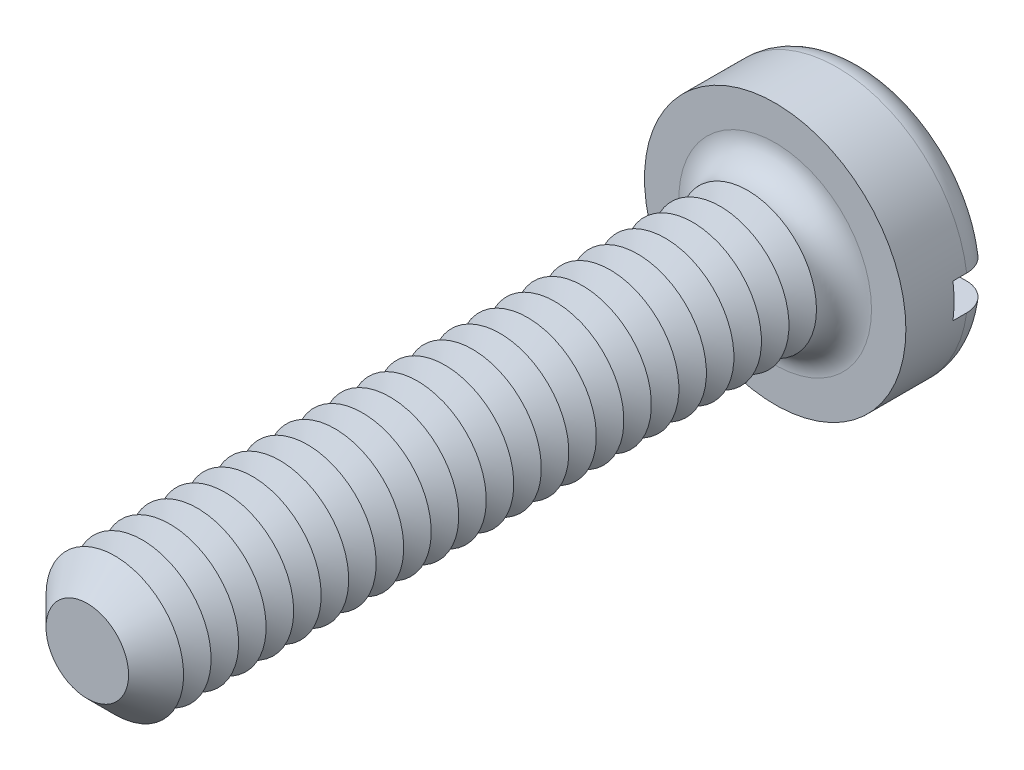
ISO-10303-21;
HEADER;
FILE_DESCRIPTION(('STEP AP214'),'2;1');
FILE_NAME('part.step','',(''),(''),'','','');
FILE_SCHEMA(('AUTOMOTIVE_DESIGN { 1 0 10303 214 1 1 1 1 }'));
ENDSEC;
DATA;
#1=APPLICATION_CONTEXT('core data for automotive mechanical design processes');
#2=APPLICATION_PROTOCOL_DEFINITION('international standard','automotive_design',2000,#1);
#3=PRODUCT_CONTEXT('',#1,'mechanical');
#4=PRODUCT('Part','Part','',(#3));
#5=PRODUCT_RELATED_PRODUCT_CATEGORY('part','',(#4));
#6=PRODUCT_DEFINITION_FORMATION('','',#4);
#7=PRODUCT_DEFINITION_CONTEXT('part definition',#1,'design');
#8=PRODUCT_DEFINITION('design','',#6,#7);
#9=PRODUCT_DEFINITION_SHAPE('','',#8);
#10=(LENGTH_UNIT() NAMED_UNIT(*) SI_UNIT(.MILLI.,.METRE.));
#11=(NAMED_UNIT(*) PLANE_ANGLE_UNIT() SI_UNIT($,.RADIAN.));
#12=(NAMED_UNIT(*) SI_UNIT($,.STERADIAN.) SOLID_ANGLE_UNIT());
#13=UNCERTAINTY_MEASURE_WITH_UNIT(LENGTH_MEASURE(1.E-05),#10,'distance_accuracy_value','');
#14=(GEOMETRIC_REPRESENTATION_CONTEXT(3) GLOBAL_UNCERTAINTY_ASSIGNED_CONTEXT((#13)) GLOBAL_UNIT_ASSIGNED_CONTEXT((#10,
#11,#12)) REPRESENTATION_CONTEXT('',''));
#15=CARTESIAN_POINT('',(0.,0.,0.));
#16=DIRECTION('',(0.,0.,1.));
#17=DIRECTION('',(1.,0.,0.));
#18=AXIS2_PLACEMENT_3D('',#15,#16,#17);
#19=CARTESIAN_POINT('',(0.,0.,-1.3));
#20=DIRECTION('',(0.,0.,1.));
#21=DIRECTION('',(1.,0.,0.));
#22=AXIS2_PLACEMENT_3D('',#19,#20,#21);
#23=PLANE('',#22);
#24=CARTESIAN_POINT('',(0.,0.,-1.3));
#25=DIRECTION('',(0.,0.,1.));
#26=DIRECTION('',(1.,0.,0.));
#27=AXIS2_PLACEMENT_3D('',#24,#25,#26);
#28=CIRCLE('',#27,1.5);
#29=CARTESIAN_POINT('',(-1.4790199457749,0.25,-1.3));
#30=VERTEX_POINT('',#29);
#31=CARTESIAN_POINT('',(1.4790199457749,0.25,-1.3));
#32=VERTEX_POINT('',#31);
#33=EDGE_CURVE('E116',#30,#32,#28,.F.);
#34=ORIENTED_EDGE('',*,*,#33,.T.);
#35=DIRECTION('',(1.,0.,0.));
#36=VECTOR('',#35,1.);
#37=CARTESIAN_POINT('',(-1.9,0.25,-1.3));
#38=LINE('',#37,#36);
#39=EDGE_CURVE('E111',#30,#32,#38,.T.);
#40=ORIENTED_EDGE('',*,*,#39,.F.);
#41=EDGE_LOOP('',(#34,#40));
#42=FACE_BOUND('',#41,.T.);
#43=ADVANCED_FACE('F39',(#42),#23,.F.);
#44=CARTESIAN_POINT('',(0.,0.,-0.9));
#45=DIRECTION('',(0.,0.,1.));
#46=DIRECTION('',(1.,0.,0.));
#47=AXIS2_PLACEMENT_3D('',#44,#45,#46);
#48=TOROIDAL_SURFACE('',#47,1.5,0.4);
#49=CARTESIAN_POINT('',(-1.8150392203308,0.25,-1.12284384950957));
#50=CARTESIAN_POINT('',(-1.80236980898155,0.25,-1.14155059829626));
#51=CARTESIAN_POINT('',(-1.78809920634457,0.25,-1.15919399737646));
#52=CARTESIAN_POINT('',(-1.75677844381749,0.25,-1.19184073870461));
#53=CARTESIAN_POINT('',(-1.73972468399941,0.25,-1.20684060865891));
#54=CARTESIAN_POINT('',(-1.70336024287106,0.25,-1.23375848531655));
#55=CARTESIAN_POINT('',(-1.68405164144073,0.25,-1.24567930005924));
#56=CARTESIAN_POINT('',(-1.64372549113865,0.25,-1.26613528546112));
#57=CARTESIAN_POINT('',(-1.6227083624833,0.25,-1.27467128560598));
#58=CARTESIAN_POINT('',(-1.57937988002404,0.25,-1.2881995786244));
#59=CARTESIAN_POINT('',(-1.55705957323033,0.25,-1.29316318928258));
#60=CARTESIAN_POINT('',(-1.51190394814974,0.25,-1.29931753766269));
#61=CARTESIAN_POINT('',(-1.48906857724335,0.25,-1.3005078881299));
#62=CARTESIAN_POINT('',(-1.4432641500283,0.25,-1.29909058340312));
#63=CARTESIAN_POINT('',(-1.42029638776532,0.25,-1.29644099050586));
#64=CARTESIAN_POINT('',(-1.37512297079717,0.25,-1.28735146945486));
#65=CARTESIAN_POINT('',(-1.3529173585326,0.25,-1.28091133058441));
#66=CARTESIAN_POINT('',(-1.30974098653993,0.25,-1.26436295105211));
#67=CARTESIAN_POINT('',(-1.28877978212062,0.25,-1.25422975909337));
#68=CARTESIAN_POINT('',(-1.24886205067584,0.25,-1.23057736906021));
#69=CARTESIAN_POINT('',(-1.22990554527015,0.25,-1.21705813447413));
#70=CARTESIAN_POINT('',(-1.19461911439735,0.25,-1.18704970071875));
#71=CARTESIAN_POINT('',(-1.17828051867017,0.25,-1.17057070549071));
#72=CARTESIAN_POINT('',(-1.14865897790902,0.25,-1.13506201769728));
#73=CARTESIAN_POINT('',(-1.13537576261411,0.25,-1.11603255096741));
#74=CARTESIAN_POINT('',(-1.11249827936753,0.25,-1.07630328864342));
#75=CARTESIAN_POINT('',(-1.10284494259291,0.25,-1.05563752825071));
#76=CARTESIAN_POINT('',(-1.08724024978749,0.25,-1.01295282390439));
#77=CARTESIAN_POINT('',(-1.08128829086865,0.25,-0.990934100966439));
#78=CARTESIAN_POINT('',(-1.07339124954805,0.25,-0.946722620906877));
#79=CARTESIAN_POINT('',(-1.07135558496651,0.25,-0.924546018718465));
#80=CARTESIAN_POINT('',(-1.07108722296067,0.25,-0.880170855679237));
#81=CARTESIAN_POINT('',(-1.07285419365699,0.25,-0.857972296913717));
#82=CARTESIAN_POINT('',(-1.0800838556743,0.25,-0.814463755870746));
#83=CARTESIAN_POINT('',(-1.08550159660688,0.25,-0.793146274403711));
#84=CARTESIAN_POINT('',(-1.09980522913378,0.25,-0.751709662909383));
#85=CARTESIAN_POINT('',(-1.10869126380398,0.25,-0.731590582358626));
#86=CARTESIAN_POINT('',(-1.12975121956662,0.25,-0.692901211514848));
#87=CARTESIAN_POINT('',(-1.14195627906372,0.25,-0.674347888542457));
#88=CARTESIAN_POINT('',(-1.1692428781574,0.25,-0.639494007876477));
#89=CARTESIAN_POINT('',(-1.18432473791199,0.25,-0.623193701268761));
#90=CARTESIAN_POINT('',(-1.21730350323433,0.25,-0.592916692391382));
#91=CARTESIAN_POINT('',(-1.23525650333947,0.25,-0.579001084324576));
#92=CARTESIAN_POINT('',(-1.27320799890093,0.25,-0.554314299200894));
#93=CARTESIAN_POINT('',(-1.2932067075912,0.25,-0.543543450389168));
#94=CARTESIAN_POINT('',(-1.33509120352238,0.25,-0.525253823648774));
#95=CARTESIAN_POINT('',(-1.35700545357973,0.25,-0.517800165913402));
#96=CARTESIAN_POINT('',(-1.401770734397,0.25,-0.506652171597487));
#97=CARTESIAN_POINT('',(-1.42462180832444,0.25,-0.502958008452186));
#98=CARTESIAN_POINT('',(-1.4707602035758,0.25,-0.499429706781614));
#99=CARTESIAN_POINT('',(-1.49404932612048,0.25,-0.499619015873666));
#100=CARTESIAN_POINT('',(-1.54026206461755,0.25,-0.50392615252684));
#101=CARTESIAN_POINT('',(-1.56318568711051,0.25,-0.508043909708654));
#102=CARTESIAN_POINT('',(-1.60788420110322,0.25,-0.520077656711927));
#103=CARTESIAN_POINT('',(-1.6296645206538,0.25,-0.527973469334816));
#104=CARTESIAN_POINT('',(-1.67156889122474,0.25,-0.547348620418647));
#105=CARTESIAN_POINT('',(-1.69169302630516,0.25,-0.558827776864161));
#106=CARTESIAN_POINT('',(-1.72948251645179,0.25,-0.584913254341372));
#107=CARTESIAN_POINT('',(-1.74717189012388,0.25,-0.599484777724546));
#108=CARTESIAN_POINT('',(-1.77981909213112,0.25,-0.63142070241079));
#109=CARTESIAN_POINT('',(-1.79477707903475,0.25,-0.648784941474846));
#110=CARTESIAN_POINT('',(-1.82136524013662,0.25,-0.685607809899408));
#111=CARTESIAN_POINT('',(-1.83303003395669,0.25,-0.705041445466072));
#112=CARTESIAN_POINT('',(-1.85289960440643,0.25,-0.745602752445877));
#113=CARTESIAN_POINT('',(-1.86110468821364,0.25,-0.76673027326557));
#114=CARTESIAN_POINT('',(-1.87375648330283,0.25,-0.809891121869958));
#115=CARTESIAN_POINT('',(-1.87823381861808,0.25,-0.831915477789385));
#116=CARTESIAN_POINT('',(-1.88341152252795,0.25,-0.87640983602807));
#117=CARTESIAN_POINT('',(-1.88411103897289,0.25,-0.898879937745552));
#118=CARTESIAN_POINT('',(-1.88171559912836,0.25,-0.943534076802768));
#119=CARTESIAN_POINT('',(-1.87863413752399,0.25,-0.965718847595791));
#120=CARTESIAN_POINT('',(-1.86879153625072,0.25,-1.00923650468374));
#121=CARTESIAN_POINT('',(-1.86203494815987,0.25,-1.03057040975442));
#122=CARTESIAN_POINT('',(-1.84837477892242,0.25,-1.06373797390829));
#123=CARTESIAN_POINT('',(-1.84255723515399,0.25,-1.07603047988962));
#124=CARTESIAN_POINT('',(-1.82969924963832,0.25,-1.09995814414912));
#125=CARTESIAN_POINT('',(-1.82265881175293,0.25,-1.11159330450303));
#126=CARTESIAN_POINT('',(-1.8150392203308,0.25,-1.12284384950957));
#127=B_SPLINE_CURVE_WITH_KNOTS('',3,(#49,#50,#51,#52,#53,#54,#55,#56,#57,#58,#59,#60,#61,#62,
#63,#64,#65,#66,#67,#68,#69,#70,#71,#72,#73,#74,#75,#76,#77,#78,#79,#80,#81,#82,#83,#84,#85,#86,
#87,#88,#89,#90,#91,#92,#93,#94,#95,#96,#97,#98,#99,#100,#101,#102,#103,#104,#105,#106,#107,
#108,#109,#110,#111,#112,#113,#114,#115,#116,#117,#118,#119,#120,#121,#122,#123,#124,#125,#126),
.UNSPECIFIED.,.T.,.F.,(4,2,2,2,2,2,2,2,2,2,2,2,2,2,2,2,2,2,2,2,2,2,2,2,2,2,2,2,2,2,2,2,2,2,2,2,
2,2,4),(0.,0.0677296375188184,0.135547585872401,0.203303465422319,0.27104273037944,
0.339319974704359,0.407604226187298,0.47663988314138,0.545679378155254,0.615194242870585,
0.684709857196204,0.753990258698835,0.82326452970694,0.891356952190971,0.959438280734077,
1.02592503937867,1.0924059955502,1.15808300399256,1.2237627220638,1.29008126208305,
1.35640718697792,1.4242376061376,1.49207510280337,1.5611911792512,1.63031044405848,
1.69984715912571,1.76938262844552,1.8385508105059,1.90771547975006,1.97613962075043,
2.04455978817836,2.11223135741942,2.17989691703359,2.24700094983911,2.31412011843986,
2.38100042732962,2.44779809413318,2.48853193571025,2.52926564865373),.UNSPECIFIED.);
#128=CARTESIAN_POINT('',(-1.88348082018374,0.25,-0.9));
#129=VERTEX_POINT('',#128);
#130=EDGE_CURVE('E363',#129,#30,#127,.T.);
#131=ORIENTED_EDGE('',*,*,#130,.F.);
#132=CARTESIAN_POINT('',(0.,0.,-0.9));
#133=DIRECTION('',(0.,0.,1.));
#134=DIRECTION('',(1.,0.,0.));
#135=AXIS2_PLACEMENT_3D('',#132,#133,#134);
#136=CIRCLE('',#135,1.9);
#137=CARTESIAN_POINT('',(1.88348082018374,0.25,-0.9));
#138=VERTEX_POINT('',#137);
#139=EDGE_CURVE('E125',#138,#129,#136,.T.);
#140=ORIENTED_EDGE('',*,*,#139,.F.);
#141=CARTESIAN_POINT('',(1.11362660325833,0.25,-1.07710243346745));
#142=CARTESIAN_POINT('',(1.12388366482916,0.25,-1.09736755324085));
#143=CARTESIAN_POINT('',(1.13589127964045,0.25,-1.11676768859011));
#144=CARTESIAN_POINT('',(1.16301945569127,0.25,-1.15328107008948));
#145=CARTESIAN_POINT('',(1.17814463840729,0.25,-1.17039085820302));
#146=CARTESIAN_POINT('',(1.21101661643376,0.25,-1.20182395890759));
#147=CARTESIAN_POINT('',(1.22875976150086,0.25,-1.21615108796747));
#148=CARTESIAN_POINT('',(1.26636392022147,0.25,-1.24166932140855));
#149=CARTESIAN_POINT('',(1.28622436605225,0.25,-1.25286126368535));
#150=CARTESIAN_POINT('',(1.32781377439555,0.25,-1.27196191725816));
#151=CARTESIAN_POINT('',(1.34956550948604,0.25,-1.27982107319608));
#152=CARTESIAN_POINT('',(1.39407620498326,0.25,-1.29180513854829));
#153=CARTESIAN_POINT('',(1.41683526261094,0.25,-1.29592968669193));
#154=CARTESIAN_POINT('',(1.46288034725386,0.25,-1.3003367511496));
#155=CARTESIAN_POINT('',(1.48616890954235,0.25,-1.30059287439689));
#156=CARTESIAN_POINT('',(1.53245605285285,0.25,-1.29717239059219));
#157=CARTESIAN_POINT('',(1.55545463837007,0.25,-1.29349584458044));
#158=CARTESIAN_POINT('',(1.60038828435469,0.25,-1.28232271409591));
#159=CARTESIAN_POINT('',(1.62232790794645,0.25,-1.27484449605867));
#160=CARTESIAN_POINT('',(1.66461970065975,0.25,-1.25627203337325));
#161=CARTESIAN_POINT('',(1.68497195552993,0.25,-1.24517798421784));
#162=CARTESIAN_POINT('',(1.72328060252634,0.25,-1.21981269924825));
#163=CARTESIAN_POINT('',(1.74126001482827,0.25,-1.2055762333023));
#164=CARTESIAN_POINT('',(1.77453973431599,0.25,-1.17425606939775));
#165=CARTESIAN_POINT('',(1.78984019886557,0.25,-1.1571725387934));
#166=CARTESIAN_POINT('',(1.81715014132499,0.25,-1.12084732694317));
#167=CARTESIAN_POINT('',(1.82919410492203,0.25,-1.10163156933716));
#168=CARTESIAN_POINT('',(1.84985315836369,0.25,-1.06143759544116));
#169=CARTESIAN_POINT('',(1.85846842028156,0.25,-1.04045946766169));
#170=CARTESIAN_POINT('',(1.87195437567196,0.25,-0.997526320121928));
#171=CARTESIAN_POINT('',(1.87685590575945,0.25,-0.975580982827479));
#172=CARTESIAN_POINT('',(1.88288741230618,0.25,-0.931178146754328));
#173=CARTESIAN_POINT('',(1.88401750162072,0.25,-0.908720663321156));
#174=CARTESIAN_POINT('',(1.88247598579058,0.25,-0.864033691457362));
#175=CARTESIAN_POINT('',(1.87982069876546,0.25,-0.841803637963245));
#176=CARTESIAN_POINT('',(1.87081646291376,0.25,-0.798104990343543));
#177=CARTESIAN_POINT('',(1.86446754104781,0.25,-0.776636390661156));
#178=CARTESIAN_POINT('',(1.84826063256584,0.25,-0.735060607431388));
#179=CARTESIAN_POINT('',(1.83840161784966,0.25,-0.714953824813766));
#180=CARTESIAN_POINT('',(1.81546327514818,0.25,-0.676670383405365));
#181=CARTESIAN_POINT('',(1.80238389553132,0.25,-0.658493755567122));
#182=CARTESIAN_POINT('',(1.77331327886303,0.25,-0.62448916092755));
#183=CARTESIAN_POINT('',(1.75730833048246,0.25,-0.608672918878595));
#184=CARTESIAN_POINT('',(1.72289038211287,0.25,-0.579924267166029));
#185=CARTESIAN_POINT('',(1.70447729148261,0.25,-0.566991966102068));
#186=CARTESIAN_POINT('',(1.66559643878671,0.25,-0.544254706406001));
#187=CARTESIAN_POINT('',(1.64511218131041,0.25,-0.53447796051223));
#188=CARTESIAN_POINT('',(1.60280554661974,0.25,-0.518459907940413));
#189=CARTESIAN_POINT('',(1.58098309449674,0.25,-0.512218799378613));
#190=CARTESIAN_POINT('',(1.53636184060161,0.25,-0.503375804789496));
#191=CARTESIAN_POINT('',(1.51355490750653,0.25,-0.500814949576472));
#192=CARTESIAN_POINT('',(1.46783245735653,0.25,-0.499516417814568));
#193=CARTESIAN_POINT('',(1.44491693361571,0.25,-0.500778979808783));
#194=CARTESIAN_POINT('',(1.39937748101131,0.25,-0.50711284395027));
#195=CARTESIAN_POINT('',(1.37675897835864,0.25,-0.512223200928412));
#196=CARTESIAN_POINT('',(1.33269286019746,0.25,-0.526151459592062));
#197=CARTESIAN_POINT('',(1.31124530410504,0.25,-0.534969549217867));
#198=CARTESIAN_POINT('',(1.27004097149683,0.25,-0.556118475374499));
#199=CARTESIAN_POINT('',(1.25029179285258,0.25,-0.568464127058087));
#200=CARTESIAN_POINT('',(1.21316554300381,0.25,-0.59631968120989));
#201=CARTESIAN_POINT('',(1.19578844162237,0.25,-0.611829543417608));
#202=CARTESIAN_POINT('',(1.16406059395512,0.25,-0.645459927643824));
#203=CARTESIAN_POINT('',(1.14968747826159,0.25,-0.663559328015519));
#204=CARTESIAN_POINT('',(1.12425968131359,0.25,-0.70195566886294));
#205=CARTESIAN_POINT('',(1.11320445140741,0.25,-0.722252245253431));
#206=CARTESIAN_POINT('',(1.09497726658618,0.25,-0.764020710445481));
#207=CARTESIAN_POINT('',(1.08772970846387,0.25,-0.785459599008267));
#208=CARTESIAN_POINT('',(1.07702618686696,0.25,-0.829269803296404));
#209=CARTESIAN_POINT('',(1.07357062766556,0.25,-0.851641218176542));
#210=CARTESIAN_POINT('',(1.07060826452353,0.25,-0.896160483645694));
#211=CARTESIAN_POINT('',(1.07101876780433,0.25,-0.918302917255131));
#212=CARTESIAN_POINT('',(1.07557730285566,0.25,-0.962179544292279));
#213=CARTESIAN_POINT('',(1.07972048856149,0.25,-0.983914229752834));
#214=CARTESIAN_POINT('',(1.08912066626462,0.25,-1.01754924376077));
#215=CARTESIAN_POINT('',(1.09320341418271,0.25,-1.02979035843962));
#216=CARTESIAN_POINT('',(1.10254493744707,0.25,-1.05381470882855));
#217=CARTESIAN_POINT('',(1.10780368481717,0.25,-1.06559795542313));
#218=CARTESIAN_POINT('',(1.11362660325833,0.25,-1.07710243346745));
#219=B_SPLINE_CURVE_WITH_KNOTS('',3,(#141,#142,#143,#144,#145,#146,#147,#148,#149,#150,#151,
#152,#153,#154,#155,#156,#157,#158,#159,#160,#161,#162,#163,#164,#165,#166,#167,#168,#169,#170,
#171,#172,#173,#174,#175,#176,#177,#178,#179,#180,#181,#182,#183,#184,#185,#186,#187,#188,#189,
#190,#191,#192,#193,#194,#195,#196,#197,#198,#199,#200,#201,#202,#203,#204,#205,#206,#207,#208,
#209,#210,#211,#212,#213,#214,#215,#216,#217,#218),.UNSPECIFIED.,.T.,.F.,(4,2,2,2,2,2,2,2,2,2,2,
2,2,2,2,2,2,2,2,2,2,2,2,2,2,2,2,2,2,2,2,2,2,2,2,2,2,2,4),(0.,0.0680907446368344,
0.136283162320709,0.204381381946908,0.272461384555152,0.341520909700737,0.410587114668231,
0.480124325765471,0.549660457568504,0.618863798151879,0.688063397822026,0.756532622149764,
0.824997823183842,0.892706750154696,0.960412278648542,1.02754926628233,1.09468424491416,
1.16153068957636,1.22837664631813,1.29524219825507,1.36210882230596,1.42929726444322,
1.49648823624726,1.56426429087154,1.63204414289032,1.70057395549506,1.76910804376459,
1.83834728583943,1.90759003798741,1.97712798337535,2.0466650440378,2.11566422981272,
2.18465199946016,2.25221259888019,2.3197804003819,2.38590630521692,2.45194648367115,
2.49060241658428,2.5292574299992),.UNSPECIFIED.);
#220=EDGE_CURVE('E365',#32,#138,#219,.T.);
#221=ORIENTED_EDGE('',*,*,#220,.F.);
#222=ORIENTED_EDGE('',*,*,#33,.F.);
#223=EDGE_LOOP('',(#131,#140,#221,#222));
#224=FACE_BOUND('',#223,.T.);
#225=ADVANCED_FACE('F347',(#224),#48,.T.);
#226=CARTESIAN_POINT('',(0.,0.,-1.3));
#227=DIRECTION('',(0.,0.,1.));
#228=DIRECTION('',(1.,0.,0.));
#229=AXIS2_PLACEMENT_3D('',#226,#227,#228);
#230=CYLINDRICAL_SURFACE('',#229,1.9);
#231=DIRECTION('',(0.,0.,1.));
#232=VECTOR('',#231,1.);
#233=CARTESIAN_POINT('',(1.88348082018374,0.25,-1.3));
#234=LINE('',#233,#232);
#235=CARTESIAN_POINT('',(1.88348082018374,0.25,-0.7));
#236=VERTEX_POINT('',#235);
#237=EDGE_CURVE('E381',#138,#236,#234,.T.);
#238=ORIENTED_EDGE('',*,*,#237,.F.);
#239=ORIENTED_EDGE('',*,*,#139,.T.);
#240=DIRECTION('',(0.,0.,1.));
#241=VECTOR('',#240,1.);
#242=CARTESIAN_POINT('',(-1.88348082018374,0.25,-1.3));
#243=LINE('',#242,#241);
#244=CARTESIAN_POINT('',(-1.88348082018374,0.25,-0.7));
#245=VERTEX_POINT('',#244);
#246=EDGE_CURVE('E63',#245,#129,#243,.F.);
#247=ORIENTED_EDGE('',*,*,#246,.F.);
#248=CARTESIAN_POINT('',(0.,0.,-0.7));
#249=DIRECTION('',(0.,0.,-1.));
#250=DIRECTION('',(-1.,0.,0.));
#251=AXIS2_PLACEMENT_3D('',#248,#249,#250);
#252=CIRCLE('',#251,1.9);
#253=CARTESIAN_POINT('',(-1.88348082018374,-0.25,-0.7));
#254=VERTEX_POINT('',#253);
#255=EDGE_CURVE('E43',#245,#254,#252,.F.);
#256=ORIENTED_EDGE('',*,*,#255,.T.);
#257=DIRECTION('',(0.,0.,1.));
#258=VECTOR('',#257,1.);
#259=CARTESIAN_POINT('',(-1.88348082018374,-0.25,-1.3));
#260=LINE('',#259,#258);
#261=CARTESIAN_POINT('',(-1.88348082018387,-0.25,-0.899999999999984));
#262=VERTEX_POINT('',#261);
#263=EDGE_CURVE('E378',#262,#254,#260,.T.);
#264=ORIENTED_EDGE('',*,*,#263,.F.);
#265=CARTESIAN_POINT('',(1.88348082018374,-0.25,-0.9));
#266=VERTEX_POINT('',#265);
#267=EDGE_CURVE('E127',#262,#266,#136,.T.);
#268=ORIENTED_EDGE('',*,*,#267,.T.);
#269=DIRECTION('',(0.,0.,1.));
#270=VECTOR('',#269,1.);
#271=CARTESIAN_POINT('',(1.88348082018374,-0.25,-1.3));
#272=LINE('',#271,#270);
#273=CARTESIAN_POINT('',(1.88348082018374,-0.25,-0.7));
#274=VERTEX_POINT('',#273);
#275=EDGE_CURVE('E55',#274,#266,#272,.F.);
#276=ORIENTED_EDGE('',*,*,#275,.F.);
#277=EDGE_CURVE('E11',#274,#236,#252,.F.);
#278=ORIENTED_EDGE('',*,*,#277,.T.);
#279=EDGE_LOOP('',(#238,#239,#247,#256,#264,#268,#276,#278));
#280=FACE_BOUND('',#279,.T.);
#281=CARTESIAN_POINT('',(0.,0.,0.));
#282=DIRECTION('',(0.,0.,1.));
#283=DIRECTION('',(1.,0.,0.));
#284=AXIS2_PLACEMENT_3D('',#281,#282,#283);
#285=CIRCLE('',#284,1.9);
#286=CARTESIAN_POINT('',(1.9,0.,0.));
#287=VERTEX_POINT('',#286);
#288=EDGE_CURVE('E384',#287,#287,#285,.T.);
#289=ORIENTED_EDGE('',*,*,#288,.F.);
#290=EDGE_LOOP('',(#289));
#291=FACE_BOUND('',#290,.T.);
#292=ADVANCED_FACE('F343',(#280,#291),#230,.T.);
#293=CARTESIAN_POINT('',(1.4790199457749,-0.25,-1.3));
#294=VERTEX_POINT('',#293);
#295=CARTESIAN_POINT('',(-1.4790199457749,-0.25,-1.3));
#296=VERTEX_POINT('',#295);
#297=EDGE_CURVE('E109',#294,#296,#28,.F.);
#298=ORIENTED_EDGE('',*,*,#297,.T.);
#299=DIRECTION('',(-1.,0.,0.));
#300=VECTOR('',#299,1.);
#301=CARTESIAN_POINT('',(-1.9,-0.25,-1.3));
#302=LINE('',#301,#300);
#303=EDGE_CURVE('E96',#294,#296,#302,.T.);
#304=ORIENTED_EDGE('',*,*,#303,.F.);
#305=EDGE_LOOP('',(#298,#304));
#306=FACE_BOUND('',#305,.T.);
#307=ADVANCED_FACE('F108',(#306),#23,.F.);
#308=CARTESIAN_POINT('',(0.,0.,0.));
#309=DIRECTION('',(0.,0.,1.));
#310=DIRECTION('',(1.,0.,0.));
#311=AXIS2_PLACEMENT_3D('',#308,#309,#310);
#312=PLANE('',#311);
#313=CARTESIAN_POINT('',(0.,0.,0.));
#314=DIRECTION('',(0.,0.,1.));
#315=DIRECTION('',(1.,0.,0.));
#316=AXIS2_PLACEMENT_3D('',#313,#314,#315);
#317=CIRCLE('',#316,1.4);
#318=CARTESIAN_POINT('',(1.4,0.,0.));
#319=VERTEX_POINT('',#318);
#320=EDGE_CURVE('E115',#319,#319,#317,.F.);
#321=ORIENTED_EDGE('',*,*,#320,.T.);
#322=EDGE_LOOP('',(#321));
#323=FACE_BOUND('',#322,.T.);
#324=ORIENTED_EDGE('',*,*,#288,.T.);
#325=EDGE_LOOP('',(#324));
#326=FACE_BOUND('',#325,.T.);
#327=ADVANCED_FACE('F342',(#323,#326),#312,.T.);
#328=CARTESIAN_POINT('',(-1.8150392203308,-0.25,-1.12284384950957));
#329=CARTESIAN_POINT('',(-1.82756185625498,-0.25,-1.10435021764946));
#330=CARTESIAN_POINT('',(-1.83853807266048,-0.25,-1.08479072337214));
#331=CARTESIAN_POINT('',(-1.85706233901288,-0.25,-1.04409188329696));
#332=CARTESIAN_POINT('',(-1.86460655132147,-0.25,-1.02295079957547));
#333=CARTESIAN_POINT('',(-1.87603074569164,-0.25,-0.979704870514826));
#334=CARTESIAN_POINT('',(-1.87991177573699,-0.25,-0.957600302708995));
#335=CARTESIAN_POINT('',(-1.88389586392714,-0.25,-0.913058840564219));
#336=CARTESIAN_POINT('',(-1.88399981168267,-0.25,-0.890622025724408));
#337=CARTESIAN_POINT('',(-1.88043374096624,-0.25,-0.846104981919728));
#338=CARTESIAN_POINT('',(-1.87677281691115,-0.25,-0.824024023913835));
#339=CARTESIAN_POINT('',(-1.86579880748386,-0.25,-0.780788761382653));
#340=CARTESIAN_POINT('',(-1.85848560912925,-0.25,-0.759634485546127));
#341=CARTESIAN_POINT('',(-1.8404137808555,-0.25,-0.718830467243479));
#342=CARTESIAN_POINT('',(-1.82965205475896,-0.25,-0.699182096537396));
#343=CARTESIAN_POINT('',(-1.80499939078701,-0.25,-0.661958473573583));
#344=CARTESIAN_POINT('',(-1.7911083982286,-0.25,-0.644383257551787));
#345=CARTESIAN_POINT('',(-1.76051564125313,-0.25,-0.611699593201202));
#346=CARTESIAN_POINT('',(-1.74379913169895,-0.25,-0.596604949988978));
#347=CARTESIAN_POINT('',(-1.70808901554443,-0.25,-0.569406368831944));
#348=CARTESIAN_POINT('',(-1.68909532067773,-0.25,-0.557302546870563));
#349=CARTESIAN_POINT('',(-1.64918615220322,-0.25,-0.536307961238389));
#350=CARTESIAN_POINT('',(-1.62825469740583,-0.25,-0.527447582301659));
#351=CARTESIAN_POINT('',(-1.58521203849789,-0.25,-0.513323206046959));
#352=CARTESIAN_POINT('',(-1.5631007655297,-0.25,-0.508059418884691));
#353=CARTESIAN_POINT('',(-1.51806209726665,-0.25,-0.501215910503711));
#354=CARTESIAN_POINT('',(-1.4951283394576,-0.25,-0.499678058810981));
#355=CARTESIAN_POINT('',(-1.4493239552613,-0.25,-0.500434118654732));
#356=CARTESIAN_POINT('',(-1.4264533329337,-0.25,-0.502728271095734));
#357=CARTESIAN_POINT('',(-1.38118643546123,-0.25,-0.511115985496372));
#358=CARTESIAN_POINT('',(-1.35879703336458,-0.25,-0.51724667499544));
#359=CARTESIAN_POINT('',(-1.31535851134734,-0.25,-0.533167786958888));
#360=CARTESIAN_POINT('',(-1.29430945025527,-0.25,-0.542958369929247));
#361=CARTESIAN_POINT('',(-1.25409242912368,-0.25,-0.565968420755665));
#362=CARTESIAN_POINT('',(-1.23493023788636,-0.25,-0.579197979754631));
#363=CARTESIAN_POINT('',(-1.19912477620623,-0.25,-0.608715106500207));
#364=CARTESIAN_POINT('',(-1.18248143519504,-0.25,-0.625002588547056));
#365=CARTESIAN_POINT('',(-1.15237533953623,-0.25,-0.660018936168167));
#366=CARTESIAN_POINT('',(-1.13888343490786,-0.25,-0.678722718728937));
#367=CARTESIAN_POINT('',(-1.115312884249,-0.25,-0.718170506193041));
#368=CARTESIAN_POINT('',(-1.10523377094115,-0.25,-0.738914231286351));
#369=CARTESIAN_POINT('',(-1.08901310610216,-0.25,-0.781372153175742));
#370=CARTESIAN_POINT('',(-1.08279080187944,-0.25,-0.803055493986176));
#371=CARTESIAN_POINT('',(-1.07416105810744,-0.25,-0.847167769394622));
#372=CARTESIAN_POINT('',(-1.07175306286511,-0.25,-0.869596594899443));
#373=CARTESIAN_POINT('',(-1.07084656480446,-0.25,-0.914070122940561));
#374=CARTESIAN_POINT('',(-1.07226874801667,-0.25,-0.936113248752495));
#375=CARTESIAN_POINT('',(-1.07880428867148,-0.25,-0.979644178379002));
#376=CARTESIAN_POINT('',(-1.08391755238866,-0.25,-1.00113199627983));
#377=CARTESIAN_POINT('',(-1.09764616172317,-0.25,-1.04290115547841));
#378=CARTESIAN_POINT('',(-1.10625346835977,-0.25,-1.06318514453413));
#379=CARTESIAN_POINT('',(-1.12669365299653,-0.25,-1.10205584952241));
#380=CARTESIAN_POINT('',(-1.13852679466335,-0.25,-1.12064242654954));
#381=CARTESIAN_POINT('',(-1.16529672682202,-0.25,-1.15594801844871));
#382=CARTESIAN_POINT('',(-1.18028464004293,-0.25,-1.17262825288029));
#383=CARTESIAN_POINT('',(-1.21279183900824,-0.25,-1.20330600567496));
#384=CARTESIAN_POINT('',(-1.23031142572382,-0.25,-1.21730320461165));
#385=CARTESIAN_POINT('',(-1.26781695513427,-0.25,-1.24254670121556));
#386=CARTESIAN_POINT('',(-1.28784999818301,-0.25,-1.25372305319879));
#387=CARTESIAN_POINT('',(-1.3294899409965,-0.25,-1.27260611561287));
#388=CARTESIAN_POINT('',(-1.35109697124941,-0.25,-1.28031253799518));
#389=CARTESIAN_POINT('',(-1.39558575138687,-0.25,-1.29212626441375));
#390=CARTESIAN_POINT('',(-1.4184807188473,-0.25,-1.29618386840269));
#391=CARTESIAN_POINT('',(-1.4646266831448,-0.25,-1.30039947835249));
#392=CARTESIAN_POINT('',(-1.48787767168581,-0.25,-1.30055757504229));
#393=CARTESIAN_POINT('',(-1.53407883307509,-0.25,-1.29695468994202));
#394=CARTESIAN_POINT('',(-1.55702895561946,-0.25,-1.29319306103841));
#395=CARTESIAN_POINT('',(-1.60196718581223,-0.25,-1.28183520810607));
#396=CARTESIAN_POINT('',(-1.62395508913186,-0.25,-1.27423817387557));
#397=CARTESIAN_POINT('',(-1.66614393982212,-0.25,-1.25548646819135));
#398=CARTESIAN_POINT('',(-1.68635782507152,-0.25,-1.24436087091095));
#399=CARTESIAN_POINT('',(-1.72458266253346,-0.25,-1.21884344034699));
#400=CARTESIAN_POINT('',(-1.74259637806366,-0.25,-1.20445577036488));
#401=CARTESIAN_POINT('',(-1.76968989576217,-0.25,-1.1787247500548));
#402=CARTESIAN_POINT('',(-1.77959984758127,-0.25,-1.1682407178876));
#403=CARTESIAN_POINT('',(-1.79823423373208,-0.25,-1.14626700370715));
#404=CARTESIAN_POINT('',(-1.80695867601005,-0.25,-1.1347773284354));
#405=CARTESIAN_POINT('',(-1.8150392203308,-0.25,-1.12284384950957));
#406=B_SPLINE_CURVE_WITH_KNOTS('',3,(#328,#329,#330,#331,#332,#333,#334,#335,#336,#337,#338,
#339,#340,#341,#342,#343,#344,#345,#346,#347,#348,#349,#350,#351,#352,#353,#354,#355,#356,#357,
#358,#359,#360,#361,#362,#363,#364,#365,#366,#367,#368,#369,#370,#371,#372,#373,#374,#375,#376,
#377,#378,#379,#380,#381,#382,#383,#384,#385,#386,#387,#388,#389,#390,#391,#392,#393,#394,#395,
#396,#397,#398,#399,#400,#401,#402,#403,#404,#405),.UNSPECIFIED.,.T.,.F.,(4,2,2,2,2,2,2,2,2,2,2,
2,2,2,2,2,2,2,2,2,2,2,2,2,2,2,2,2,2,2,2,2,2,2,2,2,2,2,4),(0.,0.0669512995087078,
0.133977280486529,0.200984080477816,0.267975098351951,0.334804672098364,0.401636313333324,
0.468528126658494,0.535421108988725,0.602674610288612,0.669930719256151,0.737801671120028,
0.805676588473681,0.87431077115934,0.942949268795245,1.0122625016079,1.08157877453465,
1.15110078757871,1.22062085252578,1.28946987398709,1.35830946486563,1.42565417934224,
1.49298908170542,1.55894041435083,1.62489007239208,1.69068884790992,1.75649300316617,
1.82345932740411,1.89043361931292,1.95893391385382,2.02743989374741,2.09686543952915,
2.16628937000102,2.23572476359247,2.3051748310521,2.3740669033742,2.44287154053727,
2.48607383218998,2.52927583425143),.UNSPECIFIED.);
#407=EDGE_CURVE('E103',#296,#262,#406,.T.);
#408=ORIENTED_EDGE('',*,*,#407,.F.);
#409=ORIENTED_EDGE('',*,*,#297,.F.);
#410=CARTESIAN_POINT('',(1.11362660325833,-0.25,-1.07710243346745));
#411=CARTESIAN_POINT('',(1.10368387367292,-0.25,-1.05745397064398));
#412=CARTESIAN_POINT('',(1.09537204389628,-0.25,-1.0369644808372));
#413=CARTESIAN_POINT('',(1.08229212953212,-0.25,-0.994867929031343));
#414=CARTESIAN_POINT('',(1.07752732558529,-0.25,-0.973259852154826));
#415=CARTESIAN_POINT('',(1.07171197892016,-0.25,-0.929545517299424));
#416=CARTESIAN_POINT('',(1.07066166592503,-0.25,-0.907439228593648));
#417=CARTESIAN_POINT('',(1.07231382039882,-0.25,-0.863372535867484));
#418=CARTESIAN_POINT('',(1.07501551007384,-0.25,-0.841412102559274));
#419=CARTESIAN_POINT('',(1.08404966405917,-0.25,-0.798386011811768));
#420=CARTESIAN_POINT('',(1.09036099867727,-0.25,-0.777315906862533));
#421=CARTESIAN_POINT('',(1.10638973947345,-0.25,-0.736514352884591));
#422=CARTESIAN_POINT('',(1.11610743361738,-0.25,-0.716783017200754));
#423=CARTESIAN_POINT('',(1.13878208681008,-0.25,-0.678952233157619));
#424=CARTESIAN_POINT('',(1.15177705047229,-0.25,-0.660875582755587));
#425=CARTESIAN_POINT('',(1.18055347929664,-0.25,-0.62709692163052));
#426=CARTESIAN_POINT('',(1.19633525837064,-0.25,-0.611395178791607));
#427=CARTESIAN_POINT('',(1.23062926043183,-0.25,-0.582430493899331));
#428=CARTESIAN_POINT('',(1.24919608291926,-0.25,-0.569232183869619));
#429=CARTESIAN_POINT('',(1.28825118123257,-0.25,-0.546076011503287));
#430=CARTESIAN_POINT('',(1.30873964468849,-0.25,-0.536118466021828));
#431=CARTESIAN_POINT('',(1.35144534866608,-0.25,-0.519560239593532));
#432=CARTESIAN_POINT('',(1.3736865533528,-0.25,-0.513021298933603));
#433=CARTESIAN_POINT('',(1.41894945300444,-0.25,-0.503751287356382));
#434=CARTESIAN_POINT('',(1.44197117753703,-0.25,-0.50102036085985));
#435=CARTESIAN_POINT('',(1.48824913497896,-0.25,-0.499449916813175));
#436=CARTESIAN_POINT('',(1.5115059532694,-0.25,-0.500627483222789));
#437=CARTESIAN_POINT('',(1.55748678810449,-0.25,-0.506895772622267));
#438=CARTESIAN_POINT('',(1.58021081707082,-0.25,-0.511986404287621));
#439=CARTESIAN_POINT('',(1.6243247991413,-0.25,-0.525910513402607));
#440=CARTESIAN_POINT('',(1.64572225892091,-0.25,-0.534720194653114));
#441=CARTESIAN_POINT('',(1.68671060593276,-0.25,-0.555845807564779));
#442=CARTESIAN_POINT('',(1.70630159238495,-0.25,-0.568161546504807));
#443=CARTESIAN_POINT('',(1.74289060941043,-0.25,-0.595805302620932));
#444=CARTESIAN_POINT('',(1.75991474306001,-0.25,-0.611098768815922));
#445=CARTESIAN_POINT('',(1.79111916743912,-0.25,-0.644354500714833));
#446=CARTESIAN_POINT('',(1.80529962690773,-0.25,-0.662316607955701));
#447=CARTESIAN_POINT('',(1.83025525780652,-0.25,-0.700191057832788));
#448=CARTESIAN_POINT('',(1.84106535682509,-0.25,-0.720080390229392));
#449=CARTESIAN_POINT('',(1.8591630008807,-0.25,-0.761401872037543));
#450=CARTESIAN_POINT('',(1.86645070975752,-0.25,-0.782833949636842));
#451=CARTESIAN_POINT('',(1.87724305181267,-0.25,-0.826454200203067));
#452=CARTESIAN_POINT('',(1.88077646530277,-0.25,-0.848635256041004));
#453=CARTESIAN_POINT('',(1.88405487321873,-0.25,-0.89327539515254));
#454=CARTESIAN_POINT('',(1.88379996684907,-0.25,-0.915734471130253));
#455=CARTESIAN_POINT('',(1.87951702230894,-0.25,-0.96021054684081));
#456=CARTESIAN_POINT('',(1.87550211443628,-0.25,-0.982228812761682));
#457=CARTESIAN_POINT('',(1.86383665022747,-0.25,-1.0252797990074));
#458=CARTESIAN_POINT('',(1.85618610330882,-0.25,-1.04631252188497));
#459=CARTESIAN_POINT('',(1.83746332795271,-0.25,-1.08682395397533));
#460=CARTESIAN_POINT('',(1.82638722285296,-0.25,-1.10630087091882));
#461=CARTESIAN_POINT('',(1.80113946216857,-0.25,-1.14313202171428));
#462=CARTESIAN_POINT('',(1.78696774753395,-0.25,-1.1604862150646));
#463=CARTESIAN_POINT('',(1.75585044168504,-0.25,-1.19268694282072));
#464=CARTESIAN_POINT('',(1.73888979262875,-0.25,-1.20751892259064));
#465=CARTESIAN_POINT('',(1.7027387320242,-0.25,-1.23415579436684));
#466=CARTESIAN_POINT('',(1.68354822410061,-0.25,-1.24596055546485));
#467=CARTESIAN_POINT('',(1.64329341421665,-0.25,-1.26632784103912));
#468=CARTESIAN_POINT('',(1.62221336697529,-0.25,-1.27485924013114));
#469=CARTESIAN_POINT('',(1.5789301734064,-0.25,-1.28830571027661));
#470=CARTESIAN_POINT('',(1.55672695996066,-0.25,-1.29322056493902));
#471=CARTESIAN_POINT('',(1.5115614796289,-0.25,-1.29935191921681));
#472=CARTESIAN_POINT('',(1.4885934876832,-0.25,-1.30052625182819));
#473=CARTESIAN_POINT('',(1.44278240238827,-0.25,-1.2990417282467));
#474=CARTESIAN_POINT('',(1.41993931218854,-0.25,-1.29638277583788));
#475=CARTESIAN_POINT('',(1.37479511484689,-0.25,-1.28727159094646));
#476=CARTESIAN_POINT('',(1.35250125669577,-0.25,-1.2807834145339));
#477=CARTESIAN_POINT('',(1.30930729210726,-0.25,-1.2641644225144));
#478=CARTESIAN_POINT('',(1.2884075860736,-0.25,-1.25403256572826));
#479=CARTESIAN_POINT('',(1.24854853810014,-0.25,-1.23036781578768));
#480=CARTESIAN_POINT('',(1.22959511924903,-0.25,-1.21682495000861));
#481=CARTESIAN_POINT('',(1.19427766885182,-0.25,-1.18672803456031));
#482=CARTESIAN_POINT('',(1.17791048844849,-0.25,-1.170177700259));
#483=CARTESIAN_POINT('',(1.15346856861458,-0.25,-1.14079355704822));
#484=CARTESIAN_POINT('',(1.14449891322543,-0.25,-1.12869247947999));
#485=CARTESIAN_POINT('',(1.12797460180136,-0.25,-1.10355927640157));
#486=CARTESIAN_POINT('',(1.1204199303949,-0.25,-1.09052716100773));
#487=CARTESIAN_POINT('',(1.11362660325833,-0.25,-1.07710243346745));
#488=B_SPLINE_CURVE_WITH_KNOTS('',3,(#410,#411,#412,#413,#414,#415,#416,#417,#418,#419,#420,
#421,#422,#423,#424,#425,#426,#427,#428,#429,#430,#431,#432,#433,#434,#435,#436,#437,#438,#439,
#440,#441,#442,#443,#444,#445,#446,#447,#448,#449,#450,#451,#452,#453,#454,#455,#456,#457,#458,
#459,#460,#461,#462,#463,#464,#465,#466,#467,#468,#469,#470,#471,#472,#473,#474,#475,#476,#477,
#478,#479,#480,#481,#482,#483,#484,#485,#486,#487),.UNSPECIFIED.,.T.,.F.,(4,2,2,2,2,2,2,2,2,2,2,
2,2,2,2,2,2,2,2,2,2,2,2,2,2,2,2,2,2,2,2,2,2,2,2,2,2,2,4),(0.,0.0660089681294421,
0.132078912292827,0.198152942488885,0.26421327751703,0.329890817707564,0.395573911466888,
0.462056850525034,0.528547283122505,0.596571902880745,0.664603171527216,0.733823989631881,
0.803047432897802,0.872573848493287,0.94209864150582,1.01118516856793,1.08026789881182,
1.14859228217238,1.21691261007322,1.28449938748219,1.35208302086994,1.41914473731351,
1.48620469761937,1.55303134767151,1.61985782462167,1.68676020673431,1.75366386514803,
1.82094137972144,1.88822180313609,1.95612699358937,2.0240362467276,2.09270838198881,
2.16138224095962,2.23071121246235,2.30006001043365,2.36961396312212,2.4390825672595,
2.48418340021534,2.52928374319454),.UNSPECIFIED.);
#489=EDGE_CURVE('E92',#266,#294,#488,.T.);
#490=ORIENTED_EDGE('',*,*,#489,.F.);
#491=ORIENTED_EDGE('',*,*,#267,.F.);
#492=EDGE_LOOP('',(#408,#409,#490,#491));
#493=FACE_BOUND('',#492,.T.);
#494=ADVANCED_FACE('F113',(#493),#48,.T.);
#495=CARTESIAN_POINT('',(0.,0.,0.399999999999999));
#496=DIRECTION('',(0.,0.,1.));
#497=DIRECTION('',(1.,0.,0.));
#498=AXIS2_PLACEMENT_3D('',#495,#496,#497);
#499=TOROIDAL_SURFACE('',#498,1.4,0.4);
#500=ORIENTED_EDGE('',*,*,#320,.F.);
#501=EDGE_LOOP('',(#500));
#502=FACE_BOUND('',#501,.T.);
#503=CARTESIAN_POINT('',(0.,0.,0.4));
#504=DIRECTION('',(0.,0.,-1.));
#505=DIRECTION('',(-1.,0.,0.));
#506=AXIS2_PLACEMENT_3D('',#503,#504,#505);
#507=CIRCLE('',#506,1.);
#508=CARTESIAN_POINT('',(-1.,0.,0.4));
#509=VERTEX_POINT('',#508);
#510=EDGE_CURVE('E390',#509,#509,#507,.T.);
#511=ORIENTED_EDGE('',*,*,#510,.T.);
#512=EDGE_LOOP('',(#511));
#513=FACE_BOUND('',#512,.T.);
#514=ADVANCED_FACE('F335',(#502,#513),#499,.F.);
#515=CARTESIAN_POINT('',(0.,0.,0.6));
#516=DIRECTION('',(0.,0.,-1.));
#517=DIRECTION('',(-1.,0.,0.));
#518=AXIS2_PLACEMENT_3D('',#515,#516,#517);
#519=CONICAL_SURFACE('',#518,0.653589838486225,1.0471975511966);
#520=ORIENTED_EDGE('',*,*,#510,.F.);
#521=EDGE_LOOP('',(#520));
#522=FACE_BOUND('',#521,.T.);
#523=CARTESIAN_POINT('',(0.,0.,0.6));
#524=DIRECTION('',(0.,0.,-1.));
#525=DIRECTION('',(-1.,0.,0.));
#526=AXIS2_PLACEMENT_3D('',#523,#524,#525);
#527=CIRCLE('',#526,0.653589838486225);
#528=CARTESIAN_POINT('',(-0.653589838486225,0.,0.6));
#529=VERTEX_POINT('',#528);
#530=EDGE_CURVE('E396',#529,#529,#527,.T.);
#531=ORIENTED_EDGE('',*,*,#530,.T.);
#532=EDGE_LOOP('',(#531));
#533=FACE_BOUND('',#532,.T.);
#534=ADVANCED_FACE('F331',(#522,#533),#519,.T.);
#535=CARTESIAN_POINT('',(0.,0.,0.8));
#536=DIRECTION('',(0.,0.,1.));
#537=DIRECTION('',(1.,0.,0.));
#538=AXIS2_PLACEMENT_3D('',#535,#536,#537);
#539=CONICAL_SURFACE('',#538,1.,1.0471975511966);
#540=ORIENTED_EDGE('',*,*,#530,.F.);
#541=EDGE_LOOP('',(#540));
#542=FACE_BOUND('',#541,.T.);
#543=CARTESIAN_POINT('',(0.,0.,0.8));
#544=DIRECTION('',(0.,0.,-1.));
#545=DIRECTION('',(-1.,0.,0.));
#546=AXIS2_PLACEMENT_3D('',#543,#544,#545);
#547=CIRCLE('',#546,1.);
#548=CARTESIAN_POINT('',(-1.,0.,0.8));
#549=VERTEX_POINT('',#548);
#550=EDGE_CURVE('E401',#549,#549,#547,.T.);
#551=ORIENTED_EDGE('',*,*,#550,.T.);
#552=EDGE_LOOP('',(#551));
#553=FACE_BOUND('',#552,.T.);
#554=ADVANCED_FACE('F327',(#542,#553),#539,.T.);
#555=CARTESIAN_POINT('',(0.,0.,1.));
#556=DIRECTION('',(0.,0.,-1.));
#557=DIRECTION('',(-1.,0.,0.));
#558=AXIS2_PLACEMENT_3D('',#555,#556,#557);
#559=CONICAL_SURFACE('',#558,0.653589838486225,1.0471975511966);
#560=ORIENTED_EDGE('',*,*,#550,.F.);
#561=EDGE_LOOP('',(#560));
#562=FACE_BOUND('',#561,.T.);
#563=CARTESIAN_POINT('',(0.,0.,1.));
#564=DIRECTION('',(0.,0.,-1.));
#565=DIRECTION('',(-1.,0.,0.));
#566=AXIS2_PLACEMENT_3D('',#563,#564,#565);
#567=CIRCLE('',#566,0.653589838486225);
#568=CARTESIAN_POINT('',(-0.653589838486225,0.,1.));
#569=VERTEX_POINT('',#568);
#570=EDGE_CURVE('E405',#569,#569,#567,.T.);
#571=ORIENTED_EDGE('',*,*,#570,.T.);
#572=EDGE_LOOP('',(#571));
#573=FACE_BOUND('',#572,.T.);
#574=ADVANCED_FACE('F323',(#562,#573),#559,.T.);
#575=CARTESIAN_POINT('',(0.,0.,1.2));
#576=DIRECTION('',(0.,0.,1.));
#577=DIRECTION('',(1.,0.,0.));
#578=AXIS2_PLACEMENT_3D('',#575,#576,#577);
#579=CONICAL_SURFACE('',#578,1.,1.0471975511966);
#580=ORIENTED_EDGE('',*,*,#570,.F.);
#581=EDGE_LOOP('',(#580));
#582=FACE_BOUND('',#581,.T.);
#583=CARTESIAN_POINT('',(0.,0.,1.2));
#584=DIRECTION('',(0.,0.,-1.));
#585=DIRECTION('',(-1.,0.,0.));
#586=AXIS2_PLACEMENT_3D('',#583,#584,#585);
#587=CIRCLE('',#586,1.);
#588=CARTESIAN_POINT('',(-1.,0.,1.2));
#589=VERTEX_POINT('',#588);
#590=EDGE_CURVE('E409',#589,#589,#587,.T.);
#591=ORIENTED_EDGE('',*,*,#590,.T.);
#592=EDGE_LOOP('',(#591));
#593=FACE_BOUND('',#592,.T.);
#594=ADVANCED_FACE('F319',(#582,#593),#579,.T.);
#595=CARTESIAN_POINT('',(0.,0.,1.4));
#596=DIRECTION('',(0.,0.,-1.));
#597=DIRECTION('',(-1.,0.,0.));
#598=AXIS2_PLACEMENT_3D('',#595,#596,#597);
#599=CONICAL_SURFACE('',#598,0.653589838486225,1.0471975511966);
#600=ORIENTED_EDGE('',*,*,#590,.F.);
#601=EDGE_LOOP('',(#600));
#602=FACE_BOUND('',#601,.T.);
#603=CARTESIAN_POINT('',(0.,0.,1.4));
#604=DIRECTION('',(0.,0.,-1.));
#605=DIRECTION('',(-1.,0.,0.));
#606=AXIS2_PLACEMENT_3D('',#603,#604,#605);
#607=CIRCLE('',#606,0.653589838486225);
#608=CARTESIAN_POINT('',(-0.653589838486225,0.,1.4));
#609=VERTEX_POINT('',#608);
#610=EDGE_CURVE('E413',#609,#609,#607,.T.);
#611=ORIENTED_EDGE('',*,*,#610,.T.);
#612=EDGE_LOOP('',(#611));
#613=FACE_BOUND('',#612,.T.);
#614=ADVANCED_FACE('F315',(#602,#613),#599,.T.);
#615=CARTESIAN_POINT('',(0.,0.,1.6));
#616=DIRECTION('',(0.,0.,1.));
#617=DIRECTION('',(1.,0.,0.));
#618=AXIS2_PLACEMENT_3D('',#615,#616,#617);
#619=CONICAL_SURFACE('',#618,1.,1.0471975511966);
#620=ORIENTED_EDGE('',*,*,#610,.F.);
#621=EDGE_LOOP('',(#620));
#622=FACE_BOUND('',#621,.T.);
#623=CARTESIAN_POINT('',(0.,0.,1.6));
#624=DIRECTION('',(0.,0.,-1.));
#625=DIRECTION('',(-1.,0.,0.));
#626=AXIS2_PLACEMENT_3D('',#623,#624,#625);
#627=CIRCLE('',#626,1.);
#628=CARTESIAN_POINT('',(-1.,0.,1.6));
#629=VERTEX_POINT('',#628);
#630=EDGE_CURVE('E417',#629,#629,#627,.T.);
#631=ORIENTED_EDGE('',*,*,#630,.T.);
#632=EDGE_LOOP('',(#631));
#633=FACE_BOUND('',#632,.T.);
#634=ADVANCED_FACE('F311',(#622,#633),#619,.T.);
#635=CARTESIAN_POINT('',(0.,0.,1.8));
#636=DIRECTION('',(0.,0.,-1.));
#637=DIRECTION('',(-1.,0.,0.));
#638=AXIS2_PLACEMENT_3D('',#635,#636,#637);
#639=CONICAL_SURFACE('',#638,0.653589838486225,1.0471975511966);
#640=ORIENTED_EDGE('',*,*,#630,.F.);
#641=EDGE_LOOP('',(#640));
#642=FACE_BOUND('',#641,.T.);
#643=CARTESIAN_POINT('',(0.,0.,1.8));
#644=DIRECTION('',(0.,0.,-1.));
#645=DIRECTION('',(-1.,0.,0.));
#646=AXIS2_PLACEMENT_3D('',#643,#644,#645);
#647=CIRCLE('',#646,0.653589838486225);
#648=CARTESIAN_POINT('',(-0.653589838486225,0.,1.8));
#649=VERTEX_POINT('',#648);
#650=EDGE_CURVE('E421',#649,#649,#647,.T.);
#651=ORIENTED_EDGE('',*,*,#650,.T.);
#652=EDGE_LOOP('',(#651));
#653=FACE_BOUND('',#652,.T.);
#654=ADVANCED_FACE('F307',(#642,#653),#639,.T.);
#655=CARTESIAN_POINT('',(0.,0.,2.));
#656=DIRECTION('',(0.,0.,1.));
#657=DIRECTION('',(1.,0.,0.));
#658=AXIS2_PLACEMENT_3D('',#655,#656,#657);
#659=CONICAL_SURFACE('',#658,1.,1.0471975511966);
#660=ORIENTED_EDGE('',*,*,#650,.F.);
#661=EDGE_LOOP('',(#660));
#662=FACE_BOUND('',#661,.T.);
#663=CARTESIAN_POINT('',(0.,0.,2.));
#664=DIRECTION('',(0.,0.,-1.));
#665=DIRECTION('',(-1.,0.,0.));
#666=AXIS2_PLACEMENT_3D('',#663,#664,#665);
#667=CIRCLE('',#666,1.);
#668=CARTESIAN_POINT('',(-1.,0.,2.));
#669=VERTEX_POINT('',#668);
#670=EDGE_CURVE('E425',#669,#669,#667,.T.);
#671=ORIENTED_EDGE('',*,*,#670,.T.);
#672=EDGE_LOOP('',(#671));
#673=FACE_BOUND('',#672,.T.);
#674=ADVANCED_FACE('F303',(#662,#673),#659,.T.);
#675=CARTESIAN_POINT('',(0.,0.,2.2));
#676=DIRECTION('',(0.,0.,-1.));
#677=DIRECTION('',(-1.,0.,0.));
#678=AXIS2_PLACEMENT_3D('',#675,#676,#677);
#679=CONICAL_SURFACE('',#678,0.653589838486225,1.0471975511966);
#680=ORIENTED_EDGE('',*,*,#670,.F.);
#681=EDGE_LOOP('',(#680));
#682=FACE_BOUND('',#681,.T.);
#683=CARTESIAN_POINT('',(0.,0.,2.2));
#684=DIRECTION('',(0.,0.,-1.));
#685=DIRECTION('',(-1.,0.,0.));
#686=AXIS2_PLACEMENT_3D('',#683,#684,#685);
#687=CIRCLE('',#686,0.653589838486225);
#688=CARTESIAN_POINT('',(-0.653589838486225,0.,2.2));
#689=VERTEX_POINT('',#688);
#690=EDGE_CURVE('E429',#689,#689,#687,.T.);
#691=ORIENTED_EDGE('',*,*,#690,.T.);
#692=EDGE_LOOP('',(#691));
#693=FACE_BOUND('',#692,.T.);
#694=ADVANCED_FACE('F299',(#682,#693),#679,.T.);
#695=CARTESIAN_POINT('',(0.,0.,2.4));
#696=DIRECTION('',(0.,0.,1.));
#697=DIRECTION('',(1.,0.,0.));
#698=AXIS2_PLACEMENT_3D('',#695,#696,#697);
#699=CONICAL_SURFACE('',#698,1.,1.0471975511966);
#700=ORIENTED_EDGE('',*,*,#690,.F.);
#701=EDGE_LOOP('',(#700));
#702=FACE_BOUND('',#701,.T.);
#703=CARTESIAN_POINT('',(0.,0.,2.4));
#704=DIRECTION('',(0.,0.,-1.));
#705=DIRECTION('',(-1.,0.,0.));
#706=AXIS2_PLACEMENT_3D('',#703,#704,#705);
#707=CIRCLE('',#706,1.);
#708=CARTESIAN_POINT('',(-1.,0.,2.4));
#709=VERTEX_POINT('',#708);
#710=EDGE_CURVE('E433',#709,#709,#707,.T.);
#711=ORIENTED_EDGE('',*,*,#710,.T.);
#712=EDGE_LOOP('',(#711));
#713=FACE_BOUND('',#712,.T.);
#714=ADVANCED_FACE('F295',(#702,#713),#699,.T.);
#715=CARTESIAN_POINT('',(0.,0.,2.6));
#716=DIRECTION('',(0.,0.,-1.));
#717=DIRECTION('',(-1.,0.,0.));
#718=AXIS2_PLACEMENT_3D('',#715,#716,#717);
#719=CONICAL_SURFACE('',#718,0.653589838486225,1.0471975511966);
#720=ORIENTED_EDGE('',*,*,#710,.F.);
#721=EDGE_LOOP('',(#720));
#722=FACE_BOUND('',#721,.T.);
#723=CARTESIAN_POINT('',(0.,0.,2.6));
#724=DIRECTION('',(0.,0.,-1.));
#725=DIRECTION('',(-1.,0.,0.));
#726=AXIS2_PLACEMENT_3D('',#723,#724,#725);
#727=CIRCLE('',#726,0.653589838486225);
#728=CARTESIAN_POINT('',(-0.653589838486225,0.,2.6));
#729=VERTEX_POINT('',#728);
#730=EDGE_CURVE('E437',#729,#729,#727,.T.);
#731=ORIENTED_EDGE('',*,*,#730,.T.);
#732=EDGE_LOOP('',(#731));
#733=FACE_BOUND('',#732,.T.);
#734=ADVANCED_FACE('F291',(#722,#733),#719,.T.);
#735=CARTESIAN_POINT('',(0.,0.,2.8));
#736=DIRECTION('',(0.,0.,1.));
#737=DIRECTION('',(1.,0.,0.));
#738=AXIS2_PLACEMENT_3D('',#735,#736,#737);
#739=CONICAL_SURFACE('',#738,1.,1.0471975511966);
#740=ORIENTED_EDGE('',*,*,#730,.F.);
#741=EDGE_LOOP('',(#740));
#742=FACE_BOUND('',#741,.T.);
#743=CARTESIAN_POINT('',(0.,0.,2.8));
#744=DIRECTION('',(0.,0.,-1.));
#745=DIRECTION('',(-1.,0.,0.));
#746=AXIS2_PLACEMENT_3D('',#743,#744,#745);
#747=CIRCLE('',#746,1.);
#748=CARTESIAN_POINT('',(-1.,0.,2.8));
#749=VERTEX_POINT('',#748);
#750=EDGE_CURVE('E441',#749,#749,#747,.T.);
#751=ORIENTED_EDGE('',*,*,#750,.T.);
#752=EDGE_LOOP('',(#751));
#753=FACE_BOUND('',#752,.T.);
#754=ADVANCED_FACE('F287',(#742,#753),#739,.T.);
#755=CARTESIAN_POINT('',(0.,0.,3.));
#756=DIRECTION('',(0.,0.,-1.));
#757=DIRECTION('',(-1.,0.,0.));
#758=AXIS2_PLACEMENT_3D('',#755,#756,#757);
#759=CONICAL_SURFACE('',#758,0.653589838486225,1.0471975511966);
#760=ORIENTED_EDGE('',*,*,#750,.F.);
#761=EDGE_LOOP('',(#760));
#762=FACE_BOUND('',#761,.T.);
#763=CARTESIAN_POINT('',(0.,0.,3.));
#764=DIRECTION('',(0.,0.,-1.));
#765=DIRECTION('',(-1.,0.,0.));
#766=AXIS2_PLACEMENT_3D('',#763,#764,#765);
#767=CIRCLE('',#766,0.653589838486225);
#768=CARTESIAN_POINT('',(-0.653589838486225,0.,3.));
#769=VERTEX_POINT('',#768);
#770=EDGE_CURVE('E445',#769,#769,#767,.T.);
#771=ORIENTED_EDGE('',*,*,#770,.T.);
#772=EDGE_LOOP('',(#771));
#773=FACE_BOUND('',#772,.T.);
#774=ADVANCED_FACE('F283',(#762,#773),#759,.T.);
#775=CARTESIAN_POINT('',(0.,0.,3.2));
#776=DIRECTION('',(0.,0.,1.));
#777=DIRECTION('',(1.,0.,0.));
#778=AXIS2_PLACEMENT_3D('',#775,#776,#777);
#779=CONICAL_SURFACE('',#778,1.,1.0471975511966);
#780=ORIENTED_EDGE('',*,*,#770,.F.);
#781=EDGE_LOOP('',(#780));
#782=FACE_BOUND('',#781,.T.);
#783=CARTESIAN_POINT('',(0.,0.,3.2));
#784=DIRECTION('',(0.,0.,-1.));
#785=DIRECTION('',(-1.,0.,0.));
#786=AXIS2_PLACEMENT_3D('',#783,#784,#785);
#787=CIRCLE('',#786,1.);
#788=CARTESIAN_POINT('',(-1.,0.,3.2));
#789=VERTEX_POINT('',#788);
#790=EDGE_CURVE('E449',#789,#789,#787,.T.);
#791=ORIENTED_EDGE('',*,*,#790,.T.);
#792=EDGE_LOOP('',(#791));
#793=FACE_BOUND('',#792,.T.);
#794=ADVANCED_FACE('F279',(#782,#793),#779,.T.);
#795=CARTESIAN_POINT('',(0.,0.,3.4));
#796=DIRECTION('',(0.,0.,-1.));
#797=DIRECTION('',(-1.,0.,0.));
#798=AXIS2_PLACEMENT_3D('',#795,#796,#797);
#799=CONICAL_SURFACE('',#798,0.653589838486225,1.0471975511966);
#800=ORIENTED_EDGE('',*,*,#790,.F.);
#801=EDGE_LOOP('',(#800));
#802=FACE_BOUND('',#801,.T.);
#803=CARTESIAN_POINT('',(0.,0.,3.4));
#804=DIRECTION('',(0.,0.,-1.));
#805=DIRECTION('',(-1.,0.,0.));
#806=AXIS2_PLACEMENT_3D('',#803,#804,#805);
#807=CIRCLE('',#806,0.653589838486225);
#808=CARTESIAN_POINT('',(-0.653589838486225,0.,3.4));
#809=VERTEX_POINT('',#808);
#810=EDGE_CURVE('E453',#809,#809,#807,.T.);
#811=ORIENTED_EDGE('',*,*,#810,.T.);
#812=EDGE_LOOP('',(#811));
#813=FACE_BOUND('',#812,.T.);
#814=ADVANCED_FACE('F275',(#802,#813),#799,.T.);
#815=CARTESIAN_POINT('',(0.,0.,3.6));
#816=DIRECTION('',(0.,0.,1.));
#817=DIRECTION('',(1.,0.,0.));
#818=AXIS2_PLACEMENT_3D('',#815,#816,#817);
#819=CONICAL_SURFACE('',#818,1.,1.0471975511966);
#820=ORIENTED_EDGE('',*,*,#810,.F.);
#821=EDGE_LOOP('',(#820));
#822=FACE_BOUND('',#821,.T.);
#823=CARTESIAN_POINT('',(0.,0.,3.6));
#824=DIRECTION('',(0.,0.,-1.));
#825=DIRECTION('',(-1.,0.,0.));
#826=AXIS2_PLACEMENT_3D('',#823,#824,#825);
#827=CIRCLE('',#826,1.);
#828=CARTESIAN_POINT('',(-1.,0.,3.6));
#829=VERTEX_POINT('',#828);
#830=EDGE_CURVE('E457',#829,#829,#827,.T.);
#831=ORIENTED_EDGE('',*,*,#830,.T.);
#832=EDGE_LOOP('',(#831));
#833=FACE_BOUND('',#832,.T.);
#834=ADVANCED_FACE('F271',(#822,#833),#819,.T.);
#835=CARTESIAN_POINT('',(0.,0.,3.8));
#836=DIRECTION('',(0.,0.,-1.));
#837=DIRECTION('',(-1.,0.,0.));
#838=AXIS2_PLACEMENT_3D('',#835,#836,#837);
#839=CONICAL_SURFACE('',#838,0.653589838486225,1.0471975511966);
#840=ORIENTED_EDGE('',*,*,#830,.F.);
#841=EDGE_LOOP('',(#840));
#842=FACE_BOUND('',#841,.T.);
#843=CARTESIAN_POINT('',(0.,0.,3.8));
#844=DIRECTION('',(0.,0.,-1.));
#845=DIRECTION('',(-1.,0.,0.));
#846=AXIS2_PLACEMENT_3D('',#843,#844,#845);
#847=CIRCLE('',#846,0.653589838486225);
#848=CARTESIAN_POINT('',(-0.653589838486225,0.,3.8));
#849=VERTEX_POINT('',#848);
#850=EDGE_CURVE('E461',#849,#849,#847,.T.);
#851=ORIENTED_EDGE('',*,*,#850,.T.);
#852=EDGE_LOOP('',(#851));
#853=FACE_BOUND('',#852,.T.);
#854=ADVANCED_FACE('F267',(#842,#853),#839,.T.);
#855=CARTESIAN_POINT('',(0.,0.,4.));
#856=DIRECTION('',(0.,0.,1.));
#857=DIRECTION('',(1.,0.,0.));
#858=AXIS2_PLACEMENT_3D('',#855,#856,#857);
#859=CONICAL_SURFACE('',#858,1.,1.0471975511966);
#860=ORIENTED_EDGE('',*,*,#850,.F.);
#861=EDGE_LOOP('',(#860));
#862=FACE_BOUND('',#861,.T.);
#863=CARTESIAN_POINT('',(0.,0.,4.));
#864=DIRECTION('',(0.,0.,-1.));
#865=DIRECTION('',(-1.,0.,0.));
#866=AXIS2_PLACEMENT_3D('',#863,#864,#865);
#867=CIRCLE('',#866,1.);
#868=CARTESIAN_POINT('',(-1.,0.,4.));
#869=VERTEX_POINT('',#868);
#870=EDGE_CURVE('E465',#869,#869,#867,.T.);
#871=ORIENTED_EDGE('',*,*,#870,.T.);
#872=EDGE_LOOP('',(#871));
#873=FACE_BOUND('',#872,.T.);
#874=ADVANCED_FACE('F263',(#862,#873),#859,.T.);
#875=CARTESIAN_POINT('',(0.,0.,4.2));
#876=DIRECTION('',(0.,0.,-1.));
#877=DIRECTION('',(-1.,0.,0.));
#878=AXIS2_PLACEMENT_3D('',#875,#876,#877);
#879=CONICAL_SURFACE('',#878,0.653589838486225,1.0471975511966);
#880=ORIENTED_EDGE('',*,*,#870,.F.);
#881=EDGE_LOOP('',(#880));
#882=FACE_BOUND('',#881,.T.);
#883=CARTESIAN_POINT('',(0.,0.,4.2));
#884=DIRECTION('',(0.,0.,-1.));
#885=DIRECTION('',(-1.,0.,0.));
#886=AXIS2_PLACEMENT_3D('',#883,#884,#885);
#887=CIRCLE('',#886,0.653589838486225);
#888=CARTESIAN_POINT('',(-0.653589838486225,0.,4.2));
#889=VERTEX_POINT('',#888);
#890=EDGE_CURVE('E469',#889,#889,#887,.T.);
#891=ORIENTED_EDGE('',*,*,#890,.T.);
#892=EDGE_LOOP('',(#891));
#893=FACE_BOUND('',#892,.T.);
#894=ADVANCED_FACE('F259',(#882,#893),#879,.T.);
#895=CARTESIAN_POINT('',(0.,0.,4.4));
#896=DIRECTION('',(0.,0.,1.));
#897=DIRECTION('',(1.,0.,0.));
#898=AXIS2_PLACEMENT_3D('',#895,#896,#897);
#899=CONICAL_SURFACE('',#898,1.,1.0471975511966);
#900=ORIENTED_EDGE('',*,*,#890,.F.);
#901=EDGE_LOOP('',(#900));
#902=FACE_BOUND('',#901,.T.);
#903=CARTESIAN_POINT('',(0.,0.,4.4));
#904=DIRECTION('',(0.,0.,-1.));
#905=DIRECTION('',(-1.,0.,0.));
#906=AXIS2_PLACEMENT_3D('',#903,#904,#905);
#907=CIRCLE('',#906,1.);
#908=CARTESIAN_POINT('',(-1.,0.,4.4));
#909=VERTEX_POINT('',#908);
#910=EDGE_CURVE('E473',#909,#909,#907,.T.);
#911=ORIENTED_EDGE('',*,*,#910,.T.);
#912=EDGE_LOOP('',(#911));
#913=FACE_BOUND('',#912,.T.);
#914=ADVANCED_FACE('F255',(#902,#913),#899,.T.);
#915=CARTESIAN_POINT('',(0.,0.,4.6));
#916=DIRECTION('',(0.,0.,-1.));
#917=DIRECTION('',(-1.,0.,0.));
#918=AXIS2_PLACEMENT_3D('',#915,#916,#917);
#919=CONICAL_SURFACE('',#918,0.653589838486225,1.0471975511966);
#920=ORIENTED_EDGE('',*,*,#910,.F.);
#921=EDGE_LOOP('',(#920));
#922=FACE_BOUND('',#921,.T.);
#923=CARTESIAN_POINT('',(0.,0.,4.6));
#924=DIRECTION('',(0.,0.,-1.));
#925=DIRECTION('',(-1.,0.,0.));
#926=AXIS2_PLACEMENT_3D('',#923,#924,#925);
#927=CIRCLE('',#926,0.653589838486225);
#928=CARTESIAN_POINT('',(-0.653589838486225,0.,4.6));
#929=VERTEX_POINT('',#928);
#930=EDGE_CURVE('E476',#929,#929,#927,.T.);
#931=ORIENTED_EDGE('',*,*,#930,.T.);
#932=EDGE_LOOP('',(#931));
#933=FACE_BOUND('',#932,.T.);
#934=ADVANCED_FACE('F251',(#922,#933),#919,.T.);
#935=CARTESIAN_POINT('',(0.,0.,4.8));
#936=DIRECTION('',(0.,0.,1.));
#937=DIRECTION('',(1.,0.,0.));
#938=AXIS2_PLACEMENT_3D('',#935,#936,#937);
#939=CONICAL_SURFACE('',#938,1.,1.0471975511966);
#940=ORIENTED_EDGE('',*,*,#930,.F.);
#941=EDGE_LOOP('',(#940));
#942=FACE_BOUND('',#941,.T.);
#943=CARTESIAN_POINT('',(0.,0.,4.8));
#944=DIRECTION('',(0.,0.,-1.));
#945=DIRECTION('',(-1.,0.,0.));
#946=AXIS2_PLACEMENT_3D('',#943,#944,#945);
#947=CIRCLE('',#946,1.);
#948=CARTESIAN_POINT('',(-1.,0.,4.8));
#949=VERTEX_POINT('',#948);
#950=EDGE_CURVE('E480',#949,#949,#947,.T.);
#951=ORIENTED_EDGE('',*,*,#950,.T.);
#952=EDGE_LOOP('',(#951));
#953=FACE_BOUND('',#952,.T.);
#954=ADVANCED_FACE('F247',(#942,#953),#939,.T.);
#955=CARTESIAN_POINT('',(0.,0.,5.));
#956=DIRECTION('',(0.,0.,-1.));
#957=DIRECTION('',(-1.,0.,0.));
#958=AXIS2_PLACEMENT_3D('',#955,#956,#957);
#959=CONICAL_SURFACE('',#958,0.653589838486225,1.0471975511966);
#960=ORIENTED_EDGE('',*,*,#950,.F.);
#961=EDGE_LOOP('',(#960));
#962=FACE_BOUND('',#961,.T.);
#963=CARTESIAN_POINT('',(0.,0.,5.));
#964=DIRECTION('',(0.,0.,-1.));
#965=DIRECTION('',(-1.,0.,0.));
#966=AXIS2_PLACEMENT_3D('',#963,#964,#965);
#967=CIRCLE('',#966,0.653589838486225);
#968=CARTESIAN_POINT('',(-0.653589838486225,0.,5.));
#969=VERTEX_POINT('',#968);
#970=EDGE_CURVE('E484',#969,#969,#967,.T.);
#971=ORIENTED_EDGE('',*,*,#970,.T.);
#972=EDGE_LOOP('',(#971));
#973=FACE_BOUND('',#972,.T.);
#974=ADVANCED_FACE('F243',(#962,#973),#959,.T.);
#975=CARTESIAN_POINT('',(0.,0.,5.2));
#976=DIRECTION('',(0.,0.,1.));
#977=DIRECTION('',(1.,0.,0.));
#978=AXIS2_PLACEMENT_3D('',#975,#976,#977);
#979=CONICAL_SURFACE('',#978,1.,1.0471975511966);
#980=ORIENTED_EDGE('',*,*,#970,.F.);
#981=EDGE_LOOP('',(#980));
#982=FACE_BOUND('',#981,.T.);
#983=CARTESIAN_POINT('',(0.,0.,5.2));
#984=DIRECTION('',(0.,0.,-1.));
#985=DIRECTION('',(-1.,0.,0.));
#986=AXIS2_PLACEMENT_3D('',#983,#984,#985);
#987=CIRCLE('',#986,1.);
#988=CARTESIAN_POINT('',(-1.,0.,5.2));
#989=VERTEX_POINT('',#988);
#990=EDGE_CURVE('E488',#989,#989,#987,.T.);
#991=ORIENTED_EDGE('',*,*,#990,.T.);
#992=EDGE_LOOP('',(#991));
#993=FACE_BOUND('',#992,.T.);
#994=ADVANCED_FACE('F239',(#982,#993),#979,.T.);
#995=CARTESIAN_POINT('',(0.,0.,5.4));
#996=DIRECTION('',(0.,0.,-1.));
#997=DIRECTION('',(-1.,0.,0.));
#998=AXIS2_PLACEMENT_3D('',#995,#996,#997);
#999=CONICAL_SURFACE('',#998,0.653589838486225,1.0471975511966);
#1000=ORIENTED_EDGE('',*,*,#990,.F.);
#1001=EDGE_LOOP('',(#1000));
#1002=FACE_BOUND('',#1001,.T.);
#1003=CARTESIAN_POINT('',(0.,0.,5.4));
#1004=DIRECTION('',(0.,0.,-1.));
#1005=DIRECTION('',(-1.,0.,0.));
#1006=AXIS2_PLACEMENT_3D('',#1003,#1004,#1005);
#1007=CIRCLE('',#1006,0.653589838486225);
#1008=CARTESIAN_POINT('',(-0.653589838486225,0.,5.4));
#1009=VERTEX_POINT('',#1008);
#1010=EDGE_CURVE('E492',#1009,#1009,#1007,.T.);
#1011=ORIENTED_EDGE('',*,*,#1010,.T.);
#1012=EDGE_LOOP('',(#1011));
#1013=FACE_BOUND('',#1012,.T.);
#1014=ADVANCED_FACE('F235',(#1002,#1013),#999,.T.);
#1015=CARTESIAN_POINT('',(0.,0.,5.6));
#1016=DIRECTION('',(0.,0.,1.));
#1017=DIRECTION('',(1.,0.,0.));
#1018=AXIS2_PLACEMENT_3D('',#1015,#1016,#1017);
#1019=CONICAL_SURFACE('',#1018,1.,1.0471975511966);
#1020=ORIENTED_EDGE('',*,*,#1010,.F.);
#1021=EDGE_LOOP('',(#1020));
#1022=FACE_BOUND('',#1021,.T.);
#1023=CARTESIAN_POINT('',(0.,0.,5.6));
#1024=DIRECTION('',(0.,0.,-1.));
#1025=DIRECTION('',(-1.,0.,0.));
#1026=AXIS2_PLACEMENT_3D('',#1023,#1024,#1025);
#1027=CIRCLE('',#1026,1.);
#1028=CARTESIAN_POINT('',(-1.,0.,5.6));
#1029=VERTEX_POINT('',#1028);
#1030=EDGE_CURVE('E496',#1029,#1029,#1027,.T.);
#1031=ORIENTED_EDGE('',*,*,#1030,.T.);
#1032=EDGE_LOOP('',(#1031));
#1033=FACE_BOUND('',#1032,.T.);
#1034=ADVANCED_FACE('F231',(#1022,#1033),#1019,.T.);
#1035=CARTESIAN_POINT('',(0.,0.,5.8));
#1036=DIRECTION('',(0.,0.,-1.));
#1037=DIRECTION('',(-1.,0.,0.));
#1038=AXIS2_PLACEMENT_3D('',#1035,#1036,#1037);
#1039=CONICAL_SURFACE('',#1038,0.653589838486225,1.0471975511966);
#1040=ORIENTED_EDGE('',*,*,#1030,.F.);
#1041=EDGE_LOOP('',(#1040));
#1042=FACE_BOUND('',#1041,.T.);
#1043=CARTESIAN_POINT('',(0.,0.,5.8));
#1044=DIRECTION('',(0.,0.,-1.));
#1045=DIRECTION('',(-1.,0.,0.));
#1046=AXIS2_PLACEMENT_3D('',#1043,#1044,#1045);
#1047=CIRCLE('',#1046,0.653589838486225);
#1048=CARTESIAN_POINT('',(-0.653589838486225,0.,5.8));
#1049=VERTEX_POINT('',#1048);
#1050=EDGE_CURVE('E500',#1049,#1049,#1047,.T.);
#1051=ORIENTED_EDGE('',*,*,#1050,.T.);
#1052=EDGE_LOOP('',(#1051));
#1053=FACE_BOUND('',#1052,.T.);
#1054=ADVANCED_FACE('F227',(#1042,#1053),#1039,.T.);
#1055=CARTESIAN_POINT('',(0.,0.,6.));
#1056=DIRECTION('',(0.,0.,1.));
#1057=DIRECTION('',(1.,0.,0.));
#1058=AXIS2_PLACEMENT_3D('',#1055,#1056,#1057);
#1059=CONICAL_SURFACE('',#1058,1.,1.0471975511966);
#1060=ORIENTED_EDGE('',*,*,#1050,.F.);
#1061=EDGE_LOOP('',(#1060));
#1062=FACE_BOUND('',#1061,.T.);
#1063=CARTESIAN_POINT('',(0.,0.,6.));
#1064=DIRECTION('',(0.,0.,-1.));
#1065=DIRECTION('',(-1.,0.,0.));
#1066=AXIS2_PLACEMENT_3D('',#1063,#1064,#1065);
#1067=CIRCLE('',#1066,1.);
#1068=CARTESIAN_POINT('',(-1.,0.,6.));
#1069=VERTEX_POINT('',#1068);
#1070=EDGE_CURVE('E503',#1069,#1069,#1067,.T.);
#1071=ORIENTED_EDGE('',*,*,#1070,.T.);
#1072=EDGE_LOOP('',(#1071));
#1073=FACE_BOUND('',#1072,.T.);
#1074=ADVANCED_FACE('F223',(#1062,#1073),#1059,.T.);
#1075=CARTESIAN_POINT('',(0.,0.,6.2));
#1076=DIRECTION('',(0.,0.,-1.));
#1077=DIRECTION('',(-1.,0.,0.));
#1078=AXIS2_PLACEMENT_3D('',#1075,#1076,#1077);
#1079=CONICAL_SURFACE('',#1078,0.653589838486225,1.0471975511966);
#1080=ORIENTED_EDGE('',*,*,#1070,.F.);
#1081=EDGE_LOOP('',(#1080));
#1082=FACE_BOUND('',#1081,.T.);
#1083=CARTESIAN_POINT('',(0.,0.,6.2));
#1084=DIRECTION('',(0.,0.,-1.));
#1085=DIRECTION('',(-1.,0.,0.));
#1086=AXIS2_PLACEMENT_3D('',#1083,#1084,#1085);
#1087=CIRCLE('',#1086,0.653589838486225);
#1088=CARTESIAN_POINT('',(-0.653589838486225,0.,6.2));
#1089=VERTEX_POINT('',#1088);
#1090=EDGE_CURVE('E507',#1089,#1089,#1087,.T.);
#1091=ORIENTED_EDGE('',*,*,#1090,.T.);
#1092=EDGE_LOOP('',(#1091));
#1093=FACE_BOUND('',#1092,.T.);
#1094=ADVANCED_FACE('F219',(#1082,#1093),#1079,.T.);
#1095=CARTESIAN_POINT('',(0.,0.,6.4));
#1096=DIRECTION('',(0.,0.,1.));
#1097=DIRECTION('',(1.,0.,0.));
#1098=AXIS2_PLACEMENT_3D('',#1095,#1096,#1097);
#1099=CONICAL_SURFACE('',#1098,1.,1.0471975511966);
#1100=ORIENTED_EDGE('',*,*,#1090,.F.);
#1101=EDGE_LOOP('',(#1100));
#1102=FACE_BOUND('',#1101,.T.);
#1103=CARTESIAN_POINT('',(0.,0.,6.4));
#1104=DIRECTION('',(0.,0.,-1.));
#1105=DIRECTION('',(-1.,0.,0.));
#1106=AXIS2_PLACEMENT_3D('',#1103,#1104,#1105);
#1107=CIRCLE('',#1106,1.);
#1108=CARTESIAN_POINT('',(-1.,0.,6.4));
#1109=VERTEX_POINT('',#1108);
#1110=EDGE_CURVE('E511',#1109,#1109,#1107,.T.);
#1111=ORIENTED_EDGE('',*,*,#1110,.T.);
#1112=EDGE_LOOP('',(#1111));
#1113=FACE_BOUND('',#1112,.T.);
#1114=ADVANCED_FACE('F215',(#1102,#1113),#1099,.T.);
#1115=CARTESIAN_POINT('',(0.,0.,6.6));
#1116=DIRECTION('',(0.,0.,-1.));
#1117=DIRECTION('',(-1.,0.,0.));
#1118=AXIS2_PLACEMENT_3D('',#1115,#1116,#1117);
#1119=CONICAL_SURFACE('',#1118,0.653589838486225,1.0471975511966);
#1120=ORIENTED_EDGE('',*,*,#1110,.F.);
#1121=EDGE_LOOP('',(#1120));
#1122=FACE_BOUND('',#1121,.T.);
#1123=CARTESIAN_POINT('',(0.,0.,6.6));
#1124=DIRECTION('',(0.,0.,-1.));
#1125=DIRECTION('',(-1.,0.,0.));
#1126=AXIS2_PLACEMENT_3D('',#1123,#1124,#1125);
#1127=CIRCLE('',#1126,0.653589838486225);
#1128=CARTESIAN_POINT('',(-0.653589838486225,0.,6.6));
#1129=VERTEX_POINT('',#1128);
#1130=EDGE_CURVE('E515',#1129,#1129,#1127,.T.);
#1131=ORIENTED_EDGE('',*,*,#1130,.T.);
#1132=EDGE_LOOP('',(#1131));
#1133=FACE_BOUND('',#1132,.T.);
#1134=ADVANCED_FACE('F211',(#1122,#1133),#1119,.T.);
#1135=CARTESIAN_POINT('',(0.,0.,6.8));
#1136=DIRECTION('',(0.,0.,1.));
#1137=DIRECTION('',(1.,0.,0.));
#1138=AXIS2_PLACEMENT_3D('',#1135,#1136,#1137);
#1139=CONICAL_SURFACE('',#1138,1.,1.0471975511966);
#1140=ORIENTED_EDGE('',*,*,#1130,.F.);
#1141=EDGE_LOOP('',(#1140));
#1142=FACE_BOUND('',#1141,.T.);
#1143=CARTESIAN_POINT('',(0.,0.,6.8));
#1144=DIRECTION('',(0.,0.,-1.));
#1145=DIRECTION('',(-1.,0.,0.));
#1146=AXIS2_PLACEMENT_3D('',#1143,#1144,#1145);
#1147=CIRCLE('',#1146,1.);
#1148=CARTESIAN_POINT('',(-1.,0.,6.8));
#1149=VERTEX_POINT('',#1148);
#1150=EDGE_CURVE('E518',#1149,#1149,#1147,.T.);
#1151=ORIENTED_EDGE('',*,*,#1150,.T.);
#1152=EDGE_LOOP('',(#1151));
#1153=FACE_BOUND('',#1152,.T.);
#1154=ADVANCED_FACE('F207',(#1142,#1153),#1139,.T.);
#1155=CARTESIAN_POINT('',(0.,0.,7.));
#1156=DIRECTION('',(0.,0.,-1.));
#1157=DIRECTION('',(-1.,0.,0.));
#1158=AXIS2_PLACEMENT_3D('',#1155,#1156,#1157);
#1159=CONICAL_SURFACE('',#1158,0.653589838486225,1.0471975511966);
#1160=ORIENTED_EDGE('',*,*,#1150,.F.);
#1161=EDGE_LOOP('',(#1160));
#1162=FACE_BOUND('',#1161,.T.);
#1163=CARTESIAN_POINT('',(0.,0.,7.));
#1164=DIRECTION('',(0.,0.,-1.));
#1165=DIRECTION('',(-1.,0.,0.));
#1166=AXIS2_PLACEMENT_3D('',#1163,#1164,#1165);
#1167=CIRCLE('',#1166,0.653589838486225);
#1168=CARTESIAN_POINT('',(-0.653589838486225,0.,7.));
#1169=VERTEX_POINT('',#1168);
#1170=EDGE_CURVE('E522',#1169,#1169,#1167,.T.);
#1171=ORIENTED_EDGE('',*,*,#1170,.T.);
#1172=EDGE_LOOP('',(#1171));
#1173=FACE_BOUND('',#1172,.T.);
#1174=ADVANCED_FACE('F203',(#1162,#1173),#1159,.T.);
#1175=CARTESIAN_POINT('',(0.,0.,7.2));
#1176=DIRECTION('',(0.,0.,1.));
#1177=DIRECTION('',(1.,0.,0.));
#1178=AXIS2_PLACEMENT_3D('',#1175,#1176,#1177);
#1179=CONICAL_SURFACE('',#1178,1.,1.0471975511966);
#1180=ORIENTED_EDGE('',*,*,#1170,.F.);
#1181=EDGE_LOOP('',(#1180));
#1182=FACE_BOUND('',#1181,.T.);
#1183=CARTESIAN_POINT('',(0.,0.,7.2));
#1184=DIRECTION('',(0.,0.,-1.));
#1185=DIRECTION('',(-1.,0.,0.));
#1186=AXIS2_PLACEMENT_3D('',#1183,#1184,#1185);
#1187=CIRCLE('',#1186,1.);
#1188=CARTESIAN_POINT('',(-1.,0.,7.2));
#1189=VERTEX_POINT('',#1188);
#1190=EDGE_CURVE('E526',#1189,#1189,#1187,.T.);
#1191=ORIENTED_EDGE('',*,*,#1190,.T.);
#1192=EDGE_LOOP('',(#1191));
#1193=FACE_BOUND('',#1192,.T.);
#1194=ADVANCED_FACE('F199',(#1182,#1193),#1179,.T.);
#1195=CARTESIAN_POINT('',(0.,0.,7.4));
#1196=DIRECTION('',(0.,0.,-1.));
#1197=DIRECTION('',(-1.,0.,0.));
#1198=AXIS2_PLACEMENT_3D('',#1195,#1196,#1197);
#1199=CONICAL_SURFACE('',#1198,0.653589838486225,1.0471975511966);
#1200=ORIENTED_EDGE('',*,*,#1190,.F.);
#1201=EDGE_LOOP('',(#1200));
#1202=FACE_BOUND('',#1201,.T.);
#1203=CARTESIAN_POINT('',(0.,0.,7.4));
#1204=DIRECTION('',(0.,0.,-1.));
#1205=DIRECTION('',(-1.,0.,0.));
#1206=AXIS2_PLACEMENT_3D('',#1203,#1204,#1205);
#1207=CIRCLE('',#1206,0.653589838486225);
#1208=CARTESIAN_POINT('',(-0.653589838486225,0.,7.4));
#1209=VERTEX_POINT('',#1208);
#1210=EDGE_CURVE('E529',#1209,#1209,#1207,.T.);
#1211=ORIENTED_EDGE('',*,*,#1210,.T.);
#1212=EDGE_LOOP('',(#1211));
#1213=FACE_BOUND('',#1212,.T.);
#1214=ADVANCED_FACE('F195',(#1202,#1213),#1199,.T.);
#1215=CARTESIAN_POINT('',(0.,0.,7.6));
#1216=DIRECTION('',(0.,0.,1.));
#1217=DIRECTION('',(1.,0.,0.));
#1218=AXIS2_PLACEMENT_3D('',#1215,#1216,#1217);
#1219=CONICAL_SURFACE('',#1218,1.,1.0471975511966);
#1220=ORIENTED_EDGE('',*,*,#1210,.F.);
#1221=EDGE_LOOP('',(#1220));
#1222=FACE_BOUND('',#1221,.T.);
#1223=CARTESIAN_POINT('',(0.,0.,7.6));
#1224=DIRECTION('',(0.,0.,-1.));
#1225=DIRECTION('',(-1.,0.,0.));
#1226=AXIS2_PLACEMENT_3D('',#1223,#1224,#1225);
#1227=CIRCLE('',#1226,1.);
#1228=CARTESIAN_POINT('',(-1.,0.,7.6));
#1229=VERTEX_POINT('',#1228);
#1230=EDGE_CURVE('E533',#1229,#1229,#1227,.T.);
#1231=ORIENTED_EDGE('',*,*,#1230,.T.);
#1232=EDGE_LOOP('',(#1231));
#1233=FACE_BOUND('',#1232,.T.);
#1234=ADVANCED_FACE('F191',(#1222,#1233),#1219,.T.);
#1235=CARTESIAN_POINT('',(0.,0.,7.8));
#1236=DIRECTION('',(0.,0.,-1.));
#1237=DIRECTION('',(-1.,0.,0.));
#1238=AXIS2_PLACEMENT_3D('',#1235,#1236,#1237);
#1239=CONICAL_SURFACE('',#1238,0.653589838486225,1.0471975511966);
#1240=ORIENTED_EDGE('',*,*,#1230,.F.);
#1241=EDGE_LOOP('',(#1240));
#1242=FACE_BOUND('',#1241,.T.);
#1243=CARTESIAN_POINT('',(0.,0.,7.8));
#1244=DIRECTION('',(0.,0.,-1.));
#1245=DIRECTION('',(-1.,0.,0.));
#1246=AXIS2_PLACEMENT_3D('',#1243,#1244,#1245);
#1247=CIRCLE('',#1246,0.653589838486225);
#1248=CARTESIAN_POINT('',(-0.653589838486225,0.,7.8));
#1249=VERTEX_POINT('',#1248);
#1250=EDGE_CURVE('E537',#1249,#1249,#1247,.T.);
#1251=ORIENTED_EDGE('',*,*,#1250,.T.);
#1252=EDGE_LOOP('',(#1251));
#1253=FACE_BOUND('',#1252,.T.);
#1254=ADVANCED_FACE('F187',(#1242,#1253),#1239,.T.);
#1255=CARTESIAN_POINT('',(0.,0.,8.));
#1256=DIRECTION('',(0.,0.,1.));
#1257=DIRECTION('',(1.,0.,0.));
#1258=AXIS2_PLACEMENT_3D('',#1255,#1256,#1257);
#1259=CONICAL_SURFACE('',#1258,1.,1.0471975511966);
#1260=ORIENTED_EDGE('',*,*,#1250,.F.);
#1261=EDGE_LOOP('',(#1260));
#1262=FACE_BOUND('',#1261,.T.);
#1263=CARTESIAN_POINT('',(0.,0.,8.));
#1264=DIRECTION('',(0.,0.,-1.));
#1265=DIRECTION('',(-1.,0.,0.));
#1266=AXIS2_PLACEMENT_3D('',#1263,#1264,#1265);
#1267=CIRCLE('',#1266,1.);
#1268=CARTESIAN_POINT('',(-1.,0.,8.));
#1269=VERTEX_POINT('',#1268);
#1270=EDGE_CURVE('E540',#1269,#1269,#1267,.T.);
#1271=ORIENTED_EDGE('',*,*,#1270,.T.);
#1272=EDGE_LOOP('',(#1271));
#1273=FACE_BOUND('',#1272,.T.);
#1274=ADVANCED_FACE('F183',(#1262,#1273),#1259,.T.);
#1275=CARTESIAN_POINT('',(0.,0.,8.2));
#1276=DIRECTION('',(0.,0.,-1.));
#1277=DIRECTION('',(-1.,0.,0.));
#1278=AXIS2_PLACEMENT_3D('',#1275,#1276,#1277);
#1279=CONICAL_SURFACE('',#1278,0.653589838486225,1.0471975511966);
#1280=ORIENTED_EDGE('',*,*,#1270,.F.);
#1281=EDGE_LOOP('',(#1280));
#1282=FACE_BOUND('',#1281,.T.);
#1283=CARTESIAN_POINT('',(0.,0.,8.2));
#1284=DIRECTION('',(0.,0.,-1.));
#1285=DIRECTION('',(-1.,0.,0.));
#1286=AXIS2_PLACEMENT_3D('',#1283,#1284,#1285);
#1287=CIRCLE('',#1286,0.653589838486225);
#1288=CARTESIAN_POINT('',(-0.653589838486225,0.,8.2));
#1289=VERTEX_POINT('',#1288);
#1290=EDGE_CURVE('E544',#1289,#1289,#1287,.T.);
#1291=ORIENTED_EDGE('',*,*,#1290,.T.);
#1292=EDGE_LOOP('',(#1291));
#1293=FACE_BOUND('',#1292,.T.);
#1294=ADVANCED_FACE('F179',(#1282,#1293),#1279,.T.);
#1295=CARTESIAN_POINT('',(0.,0.,8.4));
#1296=DIRECTION('',(0.,0.,1.));
#1297=DIRECTION('',(1.,0.,0.));
#1298=AXIS2_PLACEMENT_3D('',#1295,#1296,#1297);
#1299=CONICAL_SURFACE('',#1298,1.,1.0471975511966);
#1300=ORIENTED_EDGE('',*,*,#1290,.F.);
#1301=EDGE_LOOP('',(#1300));
#1302=FACE_BOUND('',#1301,.T.);
#1303=CARTESIAN_POINT('',(0.,0.,8.4));
#1304=DIRECTION('',(0.,0.,-1.));
#1305=DIRECTION('',(-1.,0.,0.));
#1306=AXIS2_PLACEMENT_3D('',#1303,#1304,#1305);
#1307=CIRCLE('',#1306,1.);
#1308=CARTESIAN_POINT('',(-1.,0.,8.4));
#1309=VERTEX_POINT('',#1308);
#1310=EDGE_CURVE('E548',#1309,#1309,#1307,.T.);
#1311=ORIENTED_EDGE('',*,*,#1310,.T.);
#1312=EDGE_LOOP('',(#1311));
#1313=FACE_BOUND('',#1312,.T.);
#1314=ADVANCED_FACE('F175',(#1302,#1313),#1299,.T.);
#1315=CARTESIAN_POINT('',(0.,0.,8.6));
#1316=DIRECTION('',(0.,0.,-1.));
#1317=DIRECTION('',(-1.,0.,0.));
#1318=AXIS2_PLACEMENT_3D('',#1315,#1316,#1317);
#1319=CONICAL_SURFACE('',#1318,0.653589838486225,1.0471975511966);
#1320=ORIENTED_EDGE('',*,*,#1310,.F.);
#1321=EDGE_LOOP('',(#1320));
#1322=FACE_BOUND('',#1321,.T.);
#1323=CARTESIAN_POINT('',(0.,0.,8.6));
#1324=DIRECTION('',(0.,0.,-1.));
#1325=DIRECTION('',(-1.,0.,0.));
#1326=AXIS2_PLACEMENT_3D('',#1323,#1324,#1325);
#1327=CIRCLE('',#1326,0.653589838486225);
#1328=CARTESIAN_POINT('',(-0.653589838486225,0.,8.6));
#1329=VERTEX_POINT('',#1328);
#1330=EDGE_CURVE('E552',#1329,#1329,#1327,.T.);
#1331=ORIENTED_EDGE('',*,*,#1330,.T.);
#1332=EDGE_LOOP('',(#1331));
#1333=FACE_BOUND('',#1332,.T.);
#1334=ADVANCED_FACE('F171',(#1322,#1333),#1319,.T.);
#1335=CARTESIAN_POINT('',(0.,0.,8.8));
#1336=DIRECTION('',(0.,0.,1.));
#1337=DIRECTION('',(1.,0.,0.));
#1338=AXIS2_PLACEMENT_3D('',#1335,#1336,#1337);
#1339=CONICAL_SURFACE('',#1338,1.,1.0471975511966);
#1340=ORIENTED_EDGE('',*,*,#1330,.F.);
#1341=EDGE_LOOP('',(#1340));
#1342=FACE_BOUND('',#1341,.T.);
#1343=CARTESIAN_POINT('',(0.,0.,8.8));
#1344=DIRECTION('',(0.,0.,-1.));
#1345=DIRECTION('',(-1.,0.,0.));
#1346=AXIS2_PLACEMENT_3D('',#1343,#1344,#1345);
#1347=CIRCLE('',#1346,1.);
#1348=CARTESIAN_POINT('',(-1.,0.,8.8));
#1349=VERTEX_POINT('',#1348);
#1350=EDGE_CURVE('E556',#1349,#1349,#1347,.T.);
#1351=ORIENTED_EDGE('',*,*,#1350,.T.);
#1352=EDGE_LOOP('',(#1351));
#1353=FACE_BOUND('',#1352,.T.);
#1354=ADVANCED_FACE('F167',(#1342,#1353),#1339,.T.);
#1355=CARTESIAN_POINT('',(0.,0.,9.));
#1356=DIRECTION('',(0.,0.,-1.));
#1357=DIRECTION('',(-1.,0.,0.));
#1358=AXIS2_PLACEMENT_3D('',#1355,#1356,#1357);
#1359=CONICAL_SURFACE('',#1358,0.653589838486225,1.0471975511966);
#1360=ORIENTED_EDGE('',*,*,#1350,.F.);
#1361=EDGE_LOOP('',(#1360));
#1362=FACE_BOUND('',#1361,.T.);
#1363=CARTESIAN_POINT('',(0.,0.,9.));
#1364=DIRECTION('',(0.,0.,-1.));
#1365=DIRECTION('',(-1.,0.,0.));
#1366=AXIS2_PLACEMENT_3D('',#1363,#1364,#1365);
#1367=CIRCLE('',#1366,0.653589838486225);
#1368=CARTESIAN_POINT('',(-0.653589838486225,0.,9.));
#1369=VERTEX_POINT('',#1368);
#1370=EDGE_CURVE('E560',#1369,#1369,#1367,.T.);
#1371=ORIENTED_EDGE('',*,*,#1370,.T.);
#1372=EDGE_LOOP('',(#1371));
#1373=FACE_BOUND('',#1372,.T.);
#1374=ADVANCED_FACE('F163',(#1362,#1373),#1359,.T.);
#1375=CARTESIAN_POINT('',(0.,0.,9.2));
#1376=DIRECTION('',(0.,0.,1.));
#1377=DIRECTION('',(1.,0.,0.));
#1378=AXIS2_PLACEMENT_3D('',#1375,#1376,#1377);
#1379=CONICAL_SURFACE('',#1378,1.,1.0471975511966);
#1380=ORIENTED_EDGE('',*,*,#1370,.F.);
#1381=EDGE_LOOP('',(#1380));
#1382=FACE_BOUND('',#1381,.T.);
#1383=CARTESIAN_POINT('',(0.,0.,9.2));
#1384=DIRECTION('',(0.,0.,-1.));
#1385=DIRECTION('',(-1.,0.,0.));
#1386=AXIS2_PLACEMENT_3D('',#1383,#1384,#1385);
#1387=CIRCLE('',#1386,1.);
#1388=CARTESIAN_POINT('',(-1.,0.,9.2));
#1389=VERTEX_POINT('',#1388);
#1390=EDGE_CURVE('E564',#1389,#1389,#1387,.T.);
#1391=ORIENTED_EDGE('',*,*,#1390,.T.);
#1392=EDGE_LOOP('',(#1391));
#1393=FACE_BOUND('',#1392,.T.);
#1394=ADVANCED_FACE('F159',(#1382,#1393),#1379,.T.);
#1395=CARTESIAN_POINT('',(0.,0.,9.4));
#1396=DIRECTION('',(0.,0.,-1.));
#1397=DIRECTION('',(-1.,0.,0.));
#1398=AXIS2_PLACEMENT_3D('',#1395,#1396,#1397);
#1399=CONICAL_SURFACE('',#1398,0.653589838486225,1.0471975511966);
#1400=ORIENTED_EDGE('',*,*,#1390,.F.);
#1401=EDGE_LOOP('',(#1400));
#1402=FACE_BOUND('',#1401,.T.);
#1403=CARTESIAN_POINT('',(0.,0.,9.4));
#1404=DIRECTION('',(0.,0.,-1.));
#1405=DIRECTION('',(-1.,0.,0.));
#1406=AXIS2_PLACEMENT_3D('',#1403,#1404,#1405);
#1407=CIRCLE('',#1406,0.653589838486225);
#1408=CARTESIAN_POINT('',(-0.653589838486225,0.,9.4));
#1409=VERTEX_POINT('',#1408);
#1410=EDGE_CURVE('E568',#1409,#1409,#1407,.T.);
#1411=ORIENTED_EDGE('',*,*,#1410,.T.);
#1412=EDGE_LOOP('',(#1411));
#1413=FACE_BOUND('',#1412,.T.);
#1414=ADVANCED_FACE('F155',(#1402,#1413),#1399,.T.);
#1415=CARTESIAN_POINT('',(0.,0.,9.6));
#1416=DIRECTION('',(0.,0.,1.));
#1417=DIRECTION('',(1.,0.,0.));
#1418=AXIS2_PLACEMENT_3D('',#1415,#1416,#1417);
#1419=CONICAL_SURFACE('',#1418,1.,1.0471975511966);
#1420=ORIENTED_EDGE('',*,*,#1410,.F.);
#1421=EDGE_LOOP('',(#1420));
#1422=FACE_BOUND('',#1421,.T.);
#1423=CARTESIAN_POINT('',(0.,0.,9.6));
#1424=DIRECTION('',(0.,0.,-1.));
#1425=DIRECTION('',(-1.,0.,0.));
#1426=AXIS2_PLACEMENT_3D('',#1423,#1424,#1425);
#1427=CIRCLE('',#1426,1.);
#1428=CARTESIAN_POINT('',(-1.,0.,9.6));
#1429=VERTEX_POINT('',#1428);
#1430=EDGE_CURVE('E572',#1429,#1429,#1427,.T.);
#1431=ORIENTED_EDGE('',*,*,#1430,.T.);
#1432=EDGE_LOOP('',(#1431));
#1433=FACE_BOUND('',#1432,.T.);
#1434=ADVANCED_FACE('F150',(#1422,#1433),#1419,.T.);
#1435=CARTESIAN_POINT('',(0.,0.,10.));
#1436=DIRECTION('',(0.,0.,1.));
#1437=DIRECTION('',(1.,0.,0.));
#1438=AXIS2_PLACEMENT_3D('',#1435,#1436,#1437);
#1439=PLANE('',#1438);
#1440=CARTESIAN_POINT('',(0.,0.,10.));
#1441=DIRECTION('',(0.,0.,1.));
#1442=DIRECTION('',(1.,0.,0.));
#1443=AXIS2_PLACEMENT_3D('',#1440,#1441,#1442);
#1444=CIRCLE('',#1443,0.600000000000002);
#1445=CARTESIAN_POINT('',(0.600000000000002,0.,10.));
#1446=VERTEX_POINT('',#1445);
#1447=EDGE_CURVE('E104',#1446,#1446,#1444,.T.);
#1448=ORIENTED_EDGE('',*,*,#1447,.T.);
#1449=EDGE_LOOP('',(#1448));
#1450=FACE_BOUND('',#1449,.T.);
#1451=ADVANCED_FACE('F154',(#1450),#1439,.T.);
#1452=CARTESIAN_POINT('',(0.,0.,10.));
#1453=DIRECTION('',(0.,0.,-1.));
#1454=DIRECTION('',(-1.,0.,0.));
#1455=AXIS2_PLACEMENT_3D('',#1452,#1453,#1454);
#1456=CONICAL_SURFACE('',#1455,0.600000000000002,0.785398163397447);
#1457=ORIENTED_EDGE('',*,*,#1430,.F.);
#1458=EDGE_LOOP('',(#1457));
#1459=FACE_BOUND('',#1458,.T.);
#1460=ORIENTED_EDGE('',*,*,#1447,.F.);
#1461=EDGE_LOOP('',(#1460));
#1462=FACE_BOUND('',#1461,.T.);
#1463=ADVANCED_FACE('F41',(#1459,#1462),#1456,.T.);
#1464=CARTESIAN_POINT('',(-1.9,0.25,-0.7));
#1465=DIRECTION('',(0.,1.,0.));
#1466=DIRECTION('',(-1.,0.,0.));
#1467=AXIS2_PLACEMENT_3D('',#1464,#1465,#1466);
#1468=PLANE('',#1467);
#1469=ORIENTED_EDGE('',*,*,#246,.T.);
#1470=ORIENTED_EDGE('',*,*,#130,.T.);
#1471=ORIENTED_EDGE('',*,*,#39,.T.);
#1472=ORIENTED_EDGE('',*,*,#220,.T.);
#1473=ORIENTED_EDGE('',*,*,#237,.T.);
#1474=DIRECTION('',(1.,0.,0.));
#1475=VECTOR('',#1474,1.);
#1476=CARTESIAN_POINT('',(-1.9,0.25,-0.7));
#1477=LINE('',#1476,#1475);
#1478=EDGE_CURVE('E580',#245,#236,#1477,.T.);
#1479=ORIENTED_EDGE('',*,*,#1478,.F.);
#1480=EDGE_LOOP('',(#1469,#1470,#1471,#1472,#1473,#1479));
#1481=FACE_BOUND('',#1480,.T.);
#1482=ADVANCED_FACE('F147',(#1481),#1468,.F.);
#1483=CARTESIAN_POINT('',(-1.9,-0.25,-0.7));
#1484=DIRECTION('',(0.,-1.,0.));
#1485=DIRECTION('',(1.,0.,0.));
#1486=AXIS2_PLACEMENT_3D('',#1483,#1484,#1485);
#1487=PLANE('',#1486);
#1488=ORIENTED_EDGE('',*,*,#263,.T.);
#1489=DIRECTION('',(-1.,0.,0.));
#1490=VECTOR('',#1489,1.);
#1491=CARTESIAN_POINT('',(-1.9,-0.25,-0.7));
#1492=LINE('',#1491,#1490);
#1493=EDGE_CURVE('E582',#274,#254,#1492,.T.);
#1494=ORIENTED_EDGE('',*,*,#1493,.F.);
#1495=ORIENTED_EDGE('',*,*,#275,.T.);
#1496=ORIENTED_EDGE('',*,*,#489,.T.);
#1497=ORIENTED_EDGE('',*,*,#303,.T.);
#1498=ORIENTED_EDGE('',*,*,#407,.T.);
#1499=EDGE_LOOP('',(#1488,#1494,#1495,#1496,#1497,#1498));
#1500=FACE_BOUND('',#1499,.T.);
#1501=ADVANCED_FACE('F95',(#1500),#1487,.F.);
#1502=CARTESIAN_POINT('',(0.,0.,-0.7));
#1503=DIRECTION('',(0.,0.,-1.));
#1504=DIRECTION('',(-1.,0.,0.));
#1505=AXIS2_PLACEMENT_3D('',#1502,#1503,#1504);
#1506=PLANE('',#1505);
#1507=ORIENTED_EDGE('',*,*,#1493,.T.);
#1508=ORIENTED_EDGE('',*,*,#255,.F.);
#1509=ORIENTED_EDGE('',*,*,#1478,.T.);
#1510=ORIENTED_EDGE('',*,*,#277,.F.);
#1511=EDGE_LOOP('',(#1507,#1508,#1509,#1510));
#1512=FACE_BOUND('',#1511,.T.);
#1513=ADVANCED_FACE('F146',(#1512),#1506,.T.);
#1514=CLOSED_SHELL('',(#43,#225,#292,#307,#327,#494,#514,#534,#554,#574,#594,#614,#634,#654,
#674,#694,#714,#734,#754,#774,#794,#814,#834,#854,#874,#894,#914,#934,#954,#974,#994,#1014,
#1034,#1054,#1074,#1094,#1114,#1134,#1154,#1174,#1194,#1214,#1234,#1254,#1274,#1294,#1314,#1334,
#1354,#1374,#1394,#1414,#1434,#1451,#1463,#1482,#1501,#1513));
#1515=MANIFOLD_SOLID_BREP('B2',#1514);
#1516=ADVANCED_BREP_SHAPE_REPRESENTATION('',(#18,#1515),#14);
#1517=SHAPE_DEFINITION_REPRESENTATION(#9,#1516);
ENDSEC;
END-ISO-10303-21;
